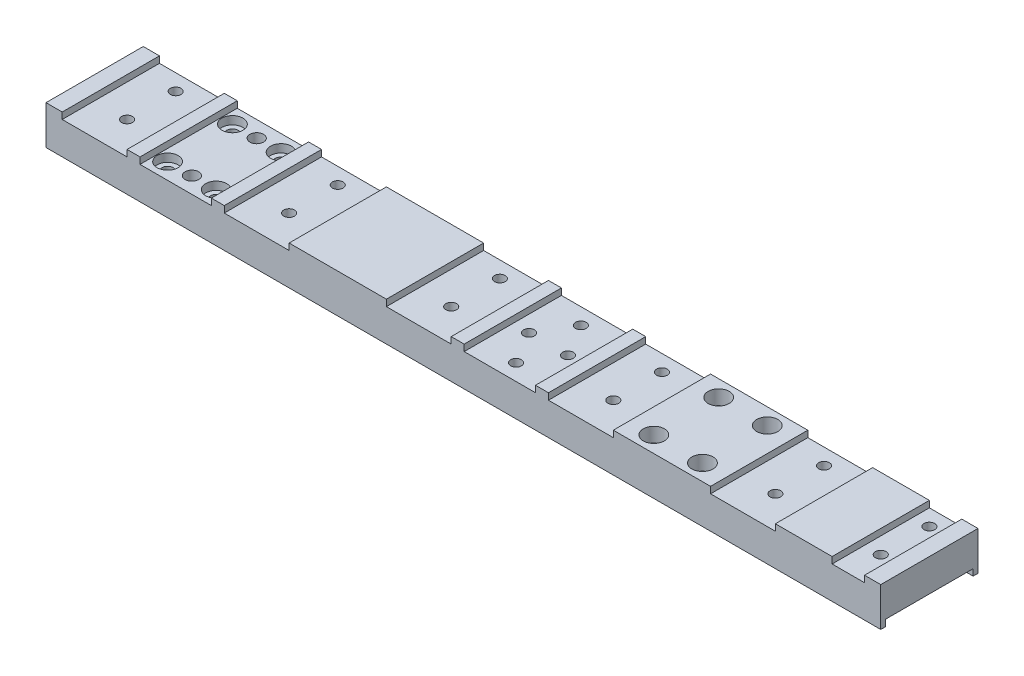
ISO-10303-21;
HEADER;
FILE_DESCRIPTION(('STEP AP214'),'2;1');
FILE_NAME('part.step','',(''),(''),'','','');
FILE_SCHEMA(('AUTOMOTIVE_DESIGN { 1 0 10303 214 1 1 1 1 }'));
ENDSEC;
DATA;
#1=APPLICATION_CONTEXT('core data for automotive mechanical design processes');
#2=APPLICATION_PROTOCOL_DEFINITION('international standard','automotive_design',2000,#1);
#3=PRODUCT_CONTEXT('',#1,'mechanical');
#4=PRODUCT('Part','Part','',(#3));
#5=PRODUCT_RELATED_PRODUCT_CATEGORY('part','',(#4));
#6=PRODUCT_DEFINITION_FORMATION('','',#4);
#7=PRODUCT_DEFINITION_CONTEXT('part definition',#1,'design');
#8=PRODUCT_DEFINITION('design','',#6,#7);
#9=PRODUCT_DEFINITION_SHAPE('','',#8);
#10=(LENGTH_UNIT() NAMED_UNIT(*) SI_UNIT(.MILLI.,.METRE.));
#11=(NAMED_UNIT(*) PLANE_ANGLE_UNIT() SI_UNIT($,.RADIAN.));
#12=(NAMED_UNIT(*) SI_UNIT($,.STERADIAN.) SOLID_ANGLE_UNIT());
#13=UNCERTAINTY_MEASURE_WITH_UNIT(LENGTH_MEASURE(1.E-05),#10,'distance_accuracy_value','');
#14=(GEOMETRIC_REPRESENTATION_CONTEXT(3) GLOBAL_UNCERTAINTY_ASSIGNED_CONTEXT((#13)) GLOBAL_UNIT_ASSIGNED_CONTEXT((#10,
#11,#12)) REPRESENTATION_CONTEXT('',''));
#15=CARTESIAN_POINT('',(0.,0.,0.));
#16=DIRECTION('',(0.,0.,1.));
#17=DIRECTION('',(1.,0.,0.));
#18=AXIS2_PLACEMENT_3D('',#15,#16,#17);
#19=CARTESIAN_POINT('',(182.500000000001,-20.,25.));
#20=DIRECTION('',(0.,1.,0.));
#21=DIRECTION('',(0.,0.,1.));
#22=AXIS2_PLACEMENT_3D('',#19,#20,#21);
#23=CYLINDRICAL_SURFACE('',#22,1.75);
#24=CARTESIAN_POINT('',(182.500000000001,2.,25.));
#25=DIRECTION('',(0.,-1.,0.));
#26=DIRECTION('',(0.,0.,-1.));
#27=AXIS2_PLACEMENT_3D('',#24,#25,#26);
#28=CIRCLE('',#27,1.75);
#29=CARTESIAN_POINT('',(182.500000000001,2.,23.25));
#30=VERTEX_POINT('',#29);
#31=EDGE_CURVE('E646',#30,#30,#28,.T.);
#32=ORIENTED_EDGE('',*,*,#31,.T.);
#33=EDGE_LOOP('',(#32));
#34=FACE_BOUND('',#33,.T.);
#35=CARTESIAN_POINT('',(182.500000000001,7.5,25.));
#36=DIRECTION('',(0.,1.,0.));
#37=DIRECTION('',(0.,0.,1.));
#38=AXIS2_PLACEMENT_3D('',#35,#36,#37);
#39=CIRCLE('',#38,1.75);
#40=CARTESIAN_POINT('',(182.500000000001,7.5,26.75));
#41=VERTEX_POINT('',#40);
#42=EDGE_CURVE('E36',#41,#41,#39,.F.);
#43=ORIENTED_EDGE('',*,*,#42,.F.);
#44=EDGE_LOOP('',(#43));
#45=FACE_BOUND('',#44,.T.);
#46=ADVANCED_FACE('F32',(#34,#45),#23,.F.);
#47=CARTESIAN_POINT('',(197.500000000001,-20.,25.));
#48=DIRECTION('',(0.,1.,0.));
#49=DIRECTION('',(0.,0.,1.));
#50=AXIS2_PLACEMENT_3D('',#47,#48,#49);
#51=CYLINDRICAL_SURFACE('',#50,1.75);
#52=CARTESIAN_POINT('',(197.500000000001,2.,25.));
#53=DIRECTION('',(0.,-1.,0.));
#54=DIRECTION('',(0.,0.,-1.));
#55=AXIS2_PLACEMENT_3D('',#52,#53,#54);
#56=CIRCLE('',#55,1.75);
#57=CARTESIAN_POINT('',(197.500000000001,2.,23.25));
#58=VERTEX_POINT('',#57);
#59=EDGE_CURVE('E643',#58,#58,#56,.T.);
#60=ORIENTED_EDGE('',*,*,#59,.T.);
#61=EDGE_LOOP('',(#60));
#62=FACE_BOUND('',#61,.T.);
#63=CARTESIAN_POINT('',(197.500000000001,7.5,25.));
#64=DIRECTION('',(0.,1.,0.));
#65=DIRECTION('',(0.,0.,1.));
#66=AXIS2_PLACEMENT_3D('',#63,#64,#65);
#67=CIRCLE('',#66,1.75);
#68=CARTESIAN_POINT('',(197.500000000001,7.5,26.75));
#69=VERTEX_POINT('',#68);
#70=EDGE_CURVE('E709',#69,#69,#67,.F.);
#71=ORIENTED_EDGE('',*,*,#70,.F.);
#72=EDGE_LOOP('',(#71));
#73=FACE_BOUND('',#72,.T.);
#74=ADVANCED_FACE('F976',(#62,#73),#51,.F.);
#75=CARTESIAN_POINT('',(197.500000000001,-20.,5.));
#76=DIRECTION('',(0.,1.,0.));
#77=DIRECTION('',(0.,0.,1.));
#78=AXIS2_PLACEMENT_3D('',#75,#76,#77);
#79=CYLINDRICAL_SURFACE('',#78,1.75);
#80=CARTESIAN_POINT('',(197.500000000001,2.,5.));
#81=DIRECTION('',(0.,-1.,0.));
#82=DIRECTION('',(0.,0.,-1.));
#83=AXIS2_PLACEMENT_3D('',#80,#81,#82);
#84=CIRCLE('',#83,1.75);
#85=CARTESIAN_POINT('',(197.500000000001,2.,3.25));
#86=VERTEX_POINT('',#85);
#87=EDGE_CURVE('E640',#86,#86,#84,.T.);
#88=ORIENTED_EDGE('',*,*,#87,.T.);
#89=EDGE_LOOP('',(#88));
#90=FACE_BOUND('',#89,.T.);
#91=CARTESIAN_POINT('',(197.500000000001,7.5,5.));
#92=DIRECTION('',(0.,1.,0.));
#93=DIRECTION('',(0.,0.,1.));
#94=AXIS2_PLACEMENT_3D('',#91,#92,#93);
#95=CIRCLE('',#94,1.75);
#96=CARTESIAN_POINT('',(197.500000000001,7.5,6.75));
#97=VERTEX_POINT('',#96);
#98=EDGE_CURVE('E705',#97,#97,#95,.F.);
#99=ORIENTED_EDGE('',*,*,#98,.F.);
#100=EDGE_LOOP('',(#99));
#101=FACE_BOUND('',#100,.T.);
#102=ADVANCED_FACE('F982',(#90,#101),#79,.F.);
#103=CARTESIAN_POINT('',(182.500000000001,-20.,5.));
#104=DIRECTION('',(0.,1.,0.));
#105=DIRECTION('',(0.,0.,1.));
#106=AXIS2_PLACEMENT_3D('',#103,#104,#105);
#107=CYLINDRICAL_SURFACE('',#106,1.75);
#108=CARTESIAN_POINT('',(182.500000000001,2.,5.));
#109=DIRECTION('',(0.,-1.,0.));
#110=DIRECTION('',(0.,0.,-1.));
#111=AXIS2_PLACEMENT_3D('',#108,#109,#110);
#112=CIRCLE('',#111,1.75);
#113=CARTESIAN_POINT('',(182.500000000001,2.,3.25));
#114=VERTEX_POINT('',#113);
#115=EDGE_CURVE('E637',#114,#114,#112,.T.);
#116=ORIENTED_EDGE('',*,*,#115,.T.);
#117=EDGE_LOOP('',(#116));
#118=FACE_BOUND('',#117,.T.);
#119=CARTESIAN_POINT('',(182.500000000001,7.5,5.));
#120=DIRECTION('',(0.,1.,0.));
#121=DIRECTION('',(0.,0.,1.));
#122=AXIS2_PLACEMENT_3D('',#119,#120,#121);
#123=CIRCLE('',#122,1.75);
#124=CARTESIAN_POINT('',(182.500000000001,7.5,6.75));
#125=VERTEX_POINT('',#124);
#126=EDGE_CURVE('E701',#125,#125,#123,.F.);
#127=ORIENTED_EDGE('',*,*,#126,.F.);
#128=EDGE_LOOP('',(#127));
#129=FACE_BOUND('',#128,.T.);
#130=ADVANCED_FACE('F992',(#118,#129),#107,.F.);
#131=CARTESIAN_POINT('',(32.5,-20.,25.));
#132=DIRECTION('',(0.,1.,0.));
#133=DIRECTION('',(0.,0.,1.));
#134=AXIS2_PLACEMENT_3D('',#131,#132,#133);
#135=CYLINDRICAL_SURFACE('',#134,1.75);
#136=CARTESIAN_POINT('',(32.5,2.,25.));
#137=DIRECTION('',(0.,-1.,0.));
#138=DIRECTION('',(0.,0.,-1.));
#139=AXIS2_PLACEMENT_3D('',#136,#137,#138);
#140=CIRCLE('',#139,1.75);
#141=CARTESIAN_POINT('',(32.5,2.,23.25));
#142=VERTEX_POINT('',#141);
#143=EDGE_CURVE('E634',#142,#142,#140,.T.);
#144=ORIENTED_EDGE('',*,*,#143,.T.);
#145=EDGE_LOOP('',(#144));
#146=FACE_BOUND('',#145,.T.);
#147=CARTESIAN_POINT('',(32.5,7.5,25.));
#148=DIRECTION('',(0.,1.,0.));
#149=DIRECTION('',(0.,0.,1.));
#150=AXIS2_PLACEMENT_3D('',#147,#148,#149);
#151=CIRCLE('',#150,1.75);
#152=CARTESIAN_POINT('',(32.5,7.5,26.75));
#153=VERTEX_POINT('',#152);
#154=EDGE_CURVE('E694',#153,#153,#151,.F.);
#155=ORIENTED_EDGE('',*,*,#154,.F.);
#156=EDGE_LOOP('',(#155));
#157=FACE_BOUND('',#156,.T.);
#158=ADVANCED_FACE('F996',(#146,#157),#135,.F.);
#159=CARTESIAN_POINT('',(47.5,-20.,25.));
#160=DIRECTION('',(0.,1.,0.));
#161=DIRECTION('',(0.,0.,1.));
#162=AXIS2_PLACEMENT_3D('',#159,#160,#161);
#163=CYLINDRICAL_SURFACE('',#162,1.75);
#164=CARTESIAN_POINT('',(47.5,2.,25.));
#165=DIRECTION('',(0.,-1.,0.));
#166=DIRECTION('',(0.,0.,-1.));
#167=AXIS2_PLACEMENT_3D('',#164,#165,#166);
#168=CIRCLE('',#167,1.75);
#169=CARTESIAN_POINT('',(47.5,2.,23.25));
#170=VERTEX_POINT('',#169);
#171=EDGE_CURVE('E631',#170,#170,#168,.T.);
#172=ORIENTED_EDGE('',*,*,#171,.T.);
#173=EDGE_LOOP('',(#172));
#174=FACE_BOUND('',#173,.T.);
#175=CARTESIAN_POINT('',(47.5,7.5,25.));
#176=DIRECTION('',(0.,1.,0.));
#177=DIRECTION('',(0.,0.,1.));
#178=AXIS2_PLACEMENT_3D('',#175,#176,#177);
#179=CIRCLE('',#178,1.75);
#180=CARTESIAN_POINT('',(47.5,7.5,26.75));
#181=VERTEX_POINT('',#180);
#182=EDGE_CURVE('E687',#181,#181,#179,.F.);
#183=ORIENTED_EDGE('',*,*,#182,.F.);
#184=EDGE_LOOP('',(#183));
#185=FACE_BOUND('',#184,.T.);
#186=ADVANCED_FACE('F1000',(#174,#185),#163,.F.);
#187=CARTESIAN_POINT('',(47.5,-20.,5.));
#188=DIRECTION('',(0.,1.,0.));
#189=DIRECTION('',(0.,0.,1.));
#190=AXIS2_PLACEMENT_3D('',#187,#188,#189);
#191=CYLINDRICAL_SURFACE('',#190,1.75);
#192=CARTESIAN_POINT('',(47.5,2.,5.));
#193=DIRECTION('',(0.,-1.,0.));
#194=DIRECTION('',(0.,0.,-1.));
#195=AXIS2_PLACEMENT_3D('',#192,#193,#194);
#196=CIRCLE('',#195,1.75);
#197=CARTESIAN_POINT('',(47.5,2.,3.25));
#198=VERTEX_POINT('',#197);
#199=EDGE_CURVE('E628',#198,#198,#196,.T.);
#200=ORIENTED_EDGE('',*,*,#199,.T.);
#201=EDGE_LOOP('',(#200));
#202=FACE_BOUND('',#201,.T.);
#203=CARTESIAN_POINT('',(47.5,7.5,5.));
#204=DIRECTION('',(0.,1.,0.));
#205=DIRECTION('',(0.,0.,1.));
#206=AXIS2_PLACEMENT_3D('',#203,#204,#205);
#207=CIRCLE('',#206,1.75);
#208=CARTESIAN_POINT('',(47.5,7.5,6.75));
#209=VERTEX_POINT('',#208);
#210=EDGE_CURVE('E680',#209,#209,#207,.F.);
#211=ORIENTED_EDGE('',*,*,#210,.F.);
#212=EDGE_LOOP('',(#211));
#213=FACE_BOUND('',#212,.T.);
#214=ADVANCED_FACE('F1004',(#202,#213),#191,.F.);
#215=CARTESIAN_POINT('',(32.5,-20.,5.));
#216=DIRECTION('',(0.,1.,0.));
#217=DIRECTION('',(0.,0.,1.));
#218=AXIS2_PLACEMENT_3D('',#215,#216,#217);
#219=CYLINDRICAL_SURFACE('',#218,1.75);
#220=CARTESIAN_POINT('',(32.5,2.,5.));
#221=DIRECTION('',(0.,-1.,0.));
#222=DIRECTION('',(0.,0.,-1.));
#223=AXIS2_PLACEMENT_3D('',#220,#221,#222);
#224=CIRCLE('',#223,1.75);
#225=CARTESIAN_POINT('',(32.5,2.,3.25));
#226=VERTEX_POINT('',#225);
#227=EDGE_CURVE('E625',#226,#226,#224,.T.);
#228=ORIENTED_EDGE('',*,*,#227,.T.);
#229=EDGE_LOOP('',(#228));
#230=FACE_BOUND('',#229,.T.);
#231=CARTESIAN_POINT('',(32.5,7.5,5.));
#232=DIRECTION('',(0.,1.,0.));
#233=DIRECTION('',(0.,0.,1.));
#234=AXIS2_PLACEMENT_3D('',#231,#232,#233);
#235=CIRCLE('',#234,1.75);
#236=CARTESIAN_POINT('',(32.5,7.5,6.75));
#237=VERTEX_POINT('',#236);
#238=EDGE_CURVE('E673',#237,#237,#235,.F.);
#239=ORIENTED_EDGE('',*,*,#238,.F.);
#240=EDGE_LOOP('',(#239));
#241=FACE_BOUND('',#240,.T.);
#242=ADVANCED_FACE('F1008',(#230,#241),#219,.F.);
#243=CARTESIAN_POINT('',(0.,0.,30.));
#244=DIRECTION('',(1.,0.,0.));
#245=DIRECTION('',(0.,0.,-1.));
#246=AXIS2_PLACEMENT_3D('',#243,#244,#245);
#247=PLANE('',#246);
#248=DIRECTION('',(0.,1.,0.));
#249=VECTOR('',#248,1.);
#250=CARTESIAN_POINT('',(0.,0.,28.5));
#251=LINE('',#250,#249);
#252=CARTESIAN_POINT('',(0.,0.,28.5));
#253=VERTEX_POINT('',#252);
#254=CARTESIAN_POINT('',(0.,2.,28.5));
#255=VERTEX_POINT('',#254);
#256=EDGE_CURVE('E320',#253,#255,#251,.T.);
#257=ORIENTED_EDGE('',*,*,#256,.F.);
#258=DIRECTION('',(0.,0.,-1.));
#259=VECTOR('',#258,1.);
#260=CARTESIAN_POINT('',(0.,0.,30.));
#261=LINE('',#260,#259);
#262=CARTESIAN_POINT('',(0.,0.,30.));
#263=VERTEX_POINT('',#262);
#264=EDGE_CURVE('E570',#263,#253,#261,.T.);
#265=ORIENTED_EDGE('',*,*,#264,.F.);
#266=DIRECTION('',(0.,-1.,0.));
#267=VECTOR('',#266,1.);
#268=CARTESIAN_POINT('',(0.,0.,30.));
#269=LINE('',#268,#267);
#270=CARTESIAN_POINT('',(0.,12.,30.));
#271=VERTEX_POINT('',#270);
#272=EDGE_CURVE('E329',#271,#263,#269,.T.);
#273=ORIENTED_EDGE('',*,*,#272,.F.);
#274=DIRECTION('',(0.,0.,-1.));
#275=VECTOR('',#274,1.);
#276=CARTESIAN_POINT('',(0.,12.,30.));
#277=LINE('',#276,#275);
#278=CARTESIAN_POINT('',(0.,12.,0.));
#279=VERTEX_POINT('',#278);
#280=EDGE_CURVE('E573',#271,#279,#277,.T.);
#281=ORIENTED_EDGE('',*,*,#280,.T.);
#282=DIRECTION('',(0.,-1.,0.));
#283=VECTOR('',#282,1.);
#284=CARTESIAN_POINT('',(0.,0.,0.));
#285=LINE('',#284,#283);
#286=CARTESIAN_POINT('',(0.,0.,0.));
#287=VERTEX_POINT('',#286);
#288=EDGE_CURVE('E402',#279,#287,#285,.T.);
#289=ORIENTED_EDGE('',*,*,#288,.T.);
#290=CARTESIAN_POINT('',(0.,0.,1.5));
#291=VERTEX_POINT('',#290);
#292=EDGE_CURVE('E569',#291,#287,#261,.T.);
#293=ORIENTED_EDGE('',*,*,#292,.F.);
#294=DIRECTION('',(0.,-1.,0.));
#295=VECTOR('',#294,1.);
#296=CARTESIAN_POINT('',(0.,0.,1.5));
#297=LINE('',#296,#295);
#298=CARTESIAN_POINT('',(0.,2.,1.5));
#299=VERTEX_POINT('',#298);
#300=EDGE_CURVE('E54',#299,#291,#297,.T.);
#301=ORIENTED_EDGE('',*,*,#300,.F.);
#302=DIRECTION('',(0.,0.,-1.));
#303=VECTOR('',#302,1.);
#304=CARTESIAN_POINT('',(0.,2.,30.));
#305=LINE('',#304,#303);
#306=EDGE_CURVE('E49',#255,#299,#305,.T.);
#307=ORIENTED_EDGE('',*,*,#306,.F.);
#308=EDGE_LOOP('',(#257,#265,#273,#281,#289,#293,#301,#307));
#309=FACE_BOUND('',#308,.T.);
#310=ADVANCED_FACE('F957',(#309),#247,.F.);
#311=CARTESIAN_POINT('',(0.,0.,30.));
#312=DIRECTION('',(0.,1.,0.));
#313=DIRECTION('',(0.,0.,1.));
#314=AXIS2_PLACEMENT_3D('',#311,#312,#313);
#315=PLANE('',#314);
#316=DIRECTION('',(-1.,0.,0.));
#317=VECTOR('',#316,1.);
#318=CARTESIAN_POINT('',(897.524083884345,0.,28.5));
#319=LINE('',#318,#317);
#320=CARTESIAN_POINT('',(257.500000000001,0.,28.5));
#321=VERTEX_POINT('',#320);
#322=EDGE_CURVE('E310',#321,#253,#319,.T.);
#323=ORIENTED_EDGE('',*,*,#322,.F.);
#324=DIRECTION('',(0.,0.,-1.));
#325=VECTOR('',#324,1.);
#326=CARTESIAN_POINT('',(257.500000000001,0.,30.));
#327=LINE('',#326,#325);
#328=CARTESIAN_POINT('',(257.500000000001,0.,30.));
#329=VERTEX_POINT('',#328);
#330=EDGE_CURVE('E567',#329,#321,#327,.T.);
#331=ORIENTED_EDGE('',*,*,#330,.F.);
#332=DIRECTION('',(1.,0.,0.));
#333=VECTOR('',#332,1.);
#334=CARTESIAN_POINT('',(0.,0.,30.));
#335=LINE('',#334,#333);
#336=EDGE_CURVE('E331',#263,#329,#335,.T.);
#337=ORIENTED_EDGE('',*,*,#336,.F.);
#338=ORIENTED_EDGE('',*,*,#264,.T.);
#339=EDGE_LOOP('',(#323,#331,#337,#338));
#340=FACE_BOUND('',#339,.T.);
#341=ADVANCED_FACE('F962',(#340),#315,.F.);
#342=DIRECTION('',(-1.,0.,0.));
#343=VECTOR('',#342,1.);
#344=CARTESIAN_POINT('',(897.524083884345,0.,1.5));
#345=LINE('',#344,#343);
#346=CARTESIAN_POINT('',(257.500000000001,0.,1.5));
#347=VERTEX_POINT('',#346);
#348=EDGE_CURVE('E304',#347,#291,#345,.T.);
#349=ORIENTED_EDGE('',*,*,#348,.T.);
#350=ORIENTED_EDGE('',*,*,#292,.T.);
#351=DIRECTION('',(1.,0.,0.));
#352=VECTOR('',#351,1.);
#353=CARTESIAN_POINT('',(0.,0.,0.));
#354=LINE('',#353,#352);
#355=CARTESIAN_POINT('',(257.500000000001,0.,0.));
#356=VERTEX_POINT('',#355);
#357=EDGE_CURVE('E405',#287,#356,#354,.T.);
#358=ORIENTED_EDGE('',*,*,#357,.T.);
#359=EDGE_CURVE('E566',#347,#356,#327,.T.);
#360=ORIENTED_EDGE('',*,*,#359,.F.);
#361=EDGE_LOOP('',(#349,#350,#358,#360));
#362=FACE_BOUND('',#361,.T.);
#363=ADVANCED_FACE('F956',(#362),#315,.F.);
#364=CARTESIAN_POINT('',(257.500000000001,0.,30.));
#365=DIRECTION('',(-1.,0.,0.));
#366=DIRECTION('',(0.,0.,1.));
#367=AXIS2_PLACEMENT_3D('',#364,#365,#366);
#368=PLANE('',#367);
#369=DIRECTION('',(0.,-1.,0.));
#370=VECTOR('',#369,1.);
#371=CARTESIAN_POINT('',(257.500000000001,0.,28.5));
#372=LINE('',#371,#370);
#373=CARTESIAN_POINT('',(257.500000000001,2.,28.5));
#374=VERTEX_POINT('',#373);
#375=EDGE_CURVE('E11',#374,#321,#372,.T.);
#376=ORIENTED_EDGE('',*,*,#375,.F.);
#377=DIRECTION('',(0.,0.,1.));
#378=VECTOR('',#377,1.);
#379=CARTESIAN_POINT('',(257.500000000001,2.,30.));
#380=LINE('',#379,#378);
#381=CARTESIAN_POINT('',(257.500000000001,2.,1.5));
#382=VERTEX_POINT('',#381);
#383=EDGE_CURVE('E41',#382,#374,#380,.T.);
#384=ORIENTED_EDGE('',*,*,#383,.F.);
#385=DIRECTION('',(0.,1.,0.));
#386=VECTOR('',#385,1.);
#387=CARTESIAN_POINT('',(257.500000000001,0.,1.5));
#388=LINE('',#387,#386);
#389=EDGE_CURVE('E291',#347,#382,#388,.T.);
#390=ORIENTED_EDGE('',*,*,#389,.F.);
#391=ORIENTED_EDGE('',*,*,#359,.T.);
#392=DIRECTION('',(0.,1.,0.));
#393=VECTOR('',#392,1.);
#394=CARTESIAN_POINT('',(257.500000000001,0.,0.));
#395=LINE('',#394,#393);
#396=CARTESIAN_POINT('',(257.500000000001,12.,0.));
#397=VERTEX_POINT('',#396);
#398=EDGE_CURVE('E408',#356,#397,#395,.T.);
#399=ORIENTED_EDGE('',*,*,#398,.T.);
#400=DIRECTION('',(0.,0.,-1.));
#401=VECTOR('',#400,1.);
#402=CARTESIAN_POINT('',(257.500000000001,12.,30.));
#403=LINE('',#402,#401);
#404=CARTESIAN_POINT('',(257.500000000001,12.,30.));
#405=VERTEX_POINT('',#404);
#406=EDGE_CURVE('E563',#405,#397,#403,.T.);
#407=ORIENTED_EDGE('',*,*,#406,.F.);
#408=DIRECTION('',(0.,1.,0.));
#409=VECTOR('',#408,1.);
#410=CARTESIAN_POINT('',(257.500000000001,0.,30.));
#411=LINE('',#410,#409);
#412=EDGE_CURVE('E333',#329,#405,#411,.T.);
#413=ORIENTED_EDGE('',*,*,#412,.F.);
#414=ORIENTED_EDGE('',*,*,#330,.T.);
#415=EDGE_LOOP('',(#376,#384,#390,#391,#399,#407,#413,#414));
#416=FACE_BOUND('',#415,.T.);
#417=ADVANCED_FACE('F290',(#416),#368,.F.);
#418=CARTESIAN_POINT('',(5.,12.,30.));
#419=DIRECTION('',(-1.,0.,0.));
#420=DIRECTION('',(0.,0.,1.));
#421=AXIS2_PLACEMENT_3D('',#418,#419,#420);
#422=PLANE('',#421);
#423=DIRECTION('',(0.,1.,0.));
#424=VECTOR('',#423,1.);
#425=CARTESIAN_POINT('',(5.,12.,0.));
#426=LINE('',#425,#424);
#427=CARTESIAN_POINT('',(5.,10.,0.));
#428=VERTEX_POINT('',#427);
#429=CARTESIAN_POINT('',(5.,12.,0.));
#430=VERTEX_POINT('',#429);
#431=EDGE_CURVE('E322',#428,#430,#426,.T.);
#432=ORIENTED_EDGE('',*,*,#431,.T.);
#433=DIRECTION('',(0.,0.,-1.));
#434=VECTOR('',#433,1.);
#435=CARTESIAN_POINT('',(5.,12.,30.));
#436=LINE('',#435,#434);
#437=CARTESIAN_POINT('',(5.,12.,30.));
#438=VERTEX_POINT('',#437);
#439=EDGE_CURVE('E305',#438,#430,#436,.T.);
#440=ORIENTED_EDGE('',*,*,#439,.F.);
#441=DIRECTION('',(0.,1.,0.));
#442=VECTOR('',#441,1.);
#443=CARTESIAN_POINT('',(5.,12.,30.));
#444=LINE('',#443,#442);
#445=CARTESIAN_POINT('',(5.,10.,30.));
#446=VERTEX_POINT('',#445);
#447=EDGE_CURVE('E323',#446,#438,#444,.T.);
#448=ORIENTED_EDGE('',*,*,#447,.F.);
#449=DIRECTION('',(0.,0.,-1.));
#450=VECTOR('',#449,1.);
#451=CARTESIAN_POINT('',(5.,10.,30.));
#452=LINE('',#451,#450);
#453=EDGE_CURVE('E397',#446,#428,#452,.T.);
#454=ORIENTED_EDGE('',*,*,#453,.T.);
#455=EDGE_LOOP('',(#432,#440,#448,#454));
#456=FACE_BOUND('',#455,.T.);
#457=ADVANCED_FACE('F34',(#456),#422,.F.);
#458=CARTESIAN_POINT('',(0.,12.,30.));
#459=DIRECTION('',(0.,-1.,0.));
#460=DIRECTION('',(0.,0.,-1.));
#461=AXIS2_PLACEMENT_3D('',#458,#459,#460);
#462=PLANE('',#461);
#463=DIRECTION('',(-1.,0.,0.));
#464=VECTOR('',#463,1.);
#465=CARTESIAN_POINT('',(0.,12.,0.));
#466=LINE('',#465,#464);
#467=EDGE_CURVE('E400',#430,#279,#466,.T.);
#468=ORIENTED_EDGE('',*,*,#467,.T.);
#469=ORIENTED_EDGE('',*,*,#280,.F.);
#470=DIRECTION('',(-1.,0.,0.));
#471=VECTOR('',#470,1.);
#472=CARTESIAN_POINT('',(0.,12.,30.));
#473=LINE('',#472,#471);
#474=EDGE_CURVE('E326',#438,#271,#473,.T.);
#475=ORIENTED_EDGE('',*,*,#474,.F.);
#476=ORIENTED_EDGE('',*,*,#439,.T.);
#477=EDGE_LOOP('',(#468,#469,#475,#476));
#478=FACE_BOUND('',#477,.T.);
#479=ADVANCED_FACE('F802',(#478),#462,.F.);
#480=CARTESIAN_POINT('',(252.500000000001,12.,30.));
#481=DIRECTION('',(0.,-1.,0.));
#482=DIRECTION('',(0.,0.,-1.));
#483=AXIS2_PLACEMENT_3D('',#480,#481,#482);
#484=PLANE('',#483);
#485=DIRECTION('',(-1.,0.,0.));
#486=VECTOR('',#485,1.);
#487=CARTESIAN_POINT('',(252.500000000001,12.,0.));
#488=LINE('',#487,#486);
#489=CARTESIAN_POINT('',(252.500000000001,12.,0.));
#490=VERTEX_POINT('',#489);
#491=EDGE_CURVE('E410',#397,#490,#488,.T.);
#492=ORIENTED_EDGE('',*,*,#491,.T.);
#493=DIRECTION('',(0.,0.,-1.));
#494=VECTOR('',#493,1.);
#495=CARTESIAN_POINT('',(252.500000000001,12.,30.));
#496=LINE('',#495,#494);
#497=CARTESIAN_POINT('',(252.500000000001,12.,30.));
#498=VERTEX_POINT('',#497);
#499=EDGE_CURVE('E560',#498,#490,#496,.T.);
#500=ORIENTED_EDGE('',*,*,#499,.F.);
#501=DIRECTION('',(-1.,0.,0.));
#502=VECTOR('',#501,1.);
#503=CARTESIAN_POINT('',(252.500000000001,12.,30.));
#504=LINE('',#503,#502);
#505=EDGE_CURVE('E335',#405,#498,#504,.T.);
#506=ORIENTED_EDGE('',*,*,#505,.F.);
#507=ORIENTED_EDGE('',*,*,#406,.T.);
#508=EDGE_LOOP('',(#492,#500,#506,#507));
#509=FACE_BOUND('',#508,.T.);
#510=ADVANCED_FACE('F952',(#509),#484,.F.);
#511=CARTESIAN_POINT('',(252.500000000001,12.,30.));
#512=DIRECTION('',(1.,0.,0.));
#513=DIRECTION('',(0.,0.,-1.));
#514=AXIS2_PLACEMENT_3D('',#511,#512,#513);
#515=PLANE('',#514);
#516=DIRECTION('',(0.,-1.,0.));
#517=VECTOR('',#516,1.);
#518=CARTESIAN_POINT('',(252.500000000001,12.,0.));
#519=LINE('',#518,#517);
#520=CARTESIAN_POINT('',(252.500000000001,10.,0.));
#521=VERTEX_POINT('',#520);
#522=EDGE_CURVE('E412',#490,#521,#519,.T.);
#523=ORIENTED_EDGE('',*,*,#522,.T.);
#524=DIRECTION('',(0.,0.,-1.));
#525=VECTOR('',#524,1.);
#526=CARTESIAN_POINT('',(252.500000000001,10.,30.));
#527=LINE('',#526,#525);
#528=CARTESIAN_POINT('',(252.500000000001,10.,30.));
#529=VERTEX_POINT('',#528);
#530=EDGE_CURVE('E557',#529,#521,#527,.T.);
#531=ORIENTED_EDGE('',*,*,#530,.F.);
#532=DIRECTION('',(0.,-1.,0.));
#533=VECTOR('',#532,1.);
#534=CARTESIAN_POINT('',(252.500000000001,12.,30.));
#535=LINE('',#534,#533);
#536=EDGE_CURVE('E337',#498,#529,#535,.T.);
#537=ORIENTED_EDGE('',*,*,#536,.F.);
#538=ORIENTED_EDGE('',*,*,#499,.T.);
#539=EDGE_LOOP('',(#523,#531,#537,#538));
#540=FACE_BOUND('',#539,.T.);
#541=ADVANCED_FACE('F947',(#540),#515,.F.);
#542=CARTESIAN_POINT('',(242.500000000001,10.,30.));
#543=DIRECTION('',(0.,-1.,0.));
#544=DIRECTION('',(0.,0.,-1.));
#545=AXIS2_PLACEMENT_3D('',#542,#543,#544);
#546=PLANE('',#545);
#547=CARTESIAN_POINT('',(247.500000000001,10.,5.));
#548=DIRECTION('',(0.,1.,0.));
#549=DIRECTION('',(0.,0.,1.));
#550=AXIS2_PLACEMENT_3D('',#547,#548,#549);
#551=CIRCLE('',#550,1.65000000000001);
#552=CARTESIAN_POINT('',(247.500000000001,10.,6.65000000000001));
#553=VERTEX_POINT('',#552);
#554=EDGE_CURVE('E624',#553,#553,#551,.T.);
#555=ORIENTED_EDGE('',*,*,#554,.F.);
#556=EDGE_LOOP('',(#555));
#557=FACE_BOUND('',#556,.T.);
#558=CARTESIAN_POINT('',(247.500000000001,10.,20.));
#559=DIRECTION('',(0.,1.,0.));
#560=DIRECTION('',(0.,0.,1.));
#561=AXIS2_PLACEMENT_3D('',#558,#559,#560);
#562=CIRCLE('',#561,1.65000000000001);
#563=CARTESIAN_POINT('',(247.500000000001,10.,21.65));
#564=VERTEX_POINT('',#563);
#565=EDGE_CURVE('E620',#564,#564,#562,.T.);
#566=ORIENTED_EDGE('',*,*,#565,.F.);
#567=EDGE_LOOP('',(#566));
#568=FACE_BOUND('',#567,.T.);
#569=DIRECTION('',(-1.,0.,0.));
#570=VECTOR('',#569,1.);
#571=CARTESIAN_POINT('',(242.500000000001,10.,0.));
#572=LINE('',#571,#570);
#573=CARTESIAN_POINT('',(242.500000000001,10.,0.));
#574=VERTEX_POINT('',#573);
#575=EDGE_CURVE('E414',#521,#574,#572,.T.);
#576=ORIENTED_EDGE('',*,*,#575,.T.);
#577=DIRECTION('',(0.,0.,-1.));
#578=VECTOR('',#577,1.);
#579=CARTESIAN_POINT('',(242.500000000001,10.,30.));
#580=LINE('',#579,#578);
#581=CARTESIAN_POINT('',(242.500000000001,10.,30.));
#582=VERTEX_POINT('',#581);
#583=EDGE_CURVE('E554',#582,#574,#580,.T.);
#584=ORIENTED_EDGE('',*,*,#583,.F.);
#585=DIRECTION('',(-1.,0.,0.));
#586=VECTOR('',#585,1.);
#587=CARTESIAN_POINT('',(242.500000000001,10.,30.));
#588=LINE('',#587,#586);
#589=EDGE_CURVE('E339',#529,#582,#588,.T.);
#590=ORIENTED_EDGE('',*,*,#589,.F.);
#591=ORIENTED_EDGE('',*,*,#530,.T.);
#592=EDGE_LOOP('',(#576,#584,#590,#591));
#593=FACE_BOUND('',#592,.T.);
#594=ADVANCED_FACE('F941',(#557,#568,#593),#546,.F.);
#595=CARTESIAN_POINT('',(242.500000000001,10.,30.));
#596=DIRECTION('',(-1.,0.,0.));
#597=DIRECTION('',(0.,0.,1.));
#598=AXIS2_PLACEMENT_3D('',#595,#596,#597);
#599=PLANE('',#598);
#600=DIRECTION('',(0.,1.,0.));
#601=VECTOR('',#600,1.);
#602=CARTESIAN_POINT('',(242.500000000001,10.,0.));
#603=LINE('',#602,#601);
#604=CARTESIAN_POINT('',(242.500000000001,12.,0.));
#605=VERTEX_POINT('',#604);
#606=EDGE_CURVE('E416',#574,#605,#603,.T.);
#607=ORIENTED_EDGE('',*,*,#606,.T.);
#608=DIRECTION('',(0.,0.,-1.));
#609=VECTOR('',#608,1.);
#610=CARTESIAN_POINT('',(242.500000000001,12.,30.));
#611=LINE('',#610,#609);
#612=CARTESIAN_POINT('',(242.500000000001,12.,30.));
#613=VERTEX_POINT('',#612);
#614=EDGE_CURVE('E551',#613,#605,#611,.T.);
#615=ORIENTED_EDGE('',*,*,#614,.F.);
#616=DIRECTION('',(0.,1.,0.));
#617=VECTOR('',#616,1.);
#618=CARTESIAN_POINT('',(242.500000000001,10.,30.));
#619=LINE('',#618,#617);
#620=EDGE_CURVE('E341',#582,#613,#619,.T.);
#621=ORIENTED_EDGE('',*,*,#620,.F.);
#622=ORIENTED_EDGE('',*,*,#583,.T.);
#623=EDGE_LOOP('',(#607,#615,#621,#622));
#624=FACE_BOUND('',#623,.T.);
#625=ADVANCED_FACE('F937',(#624),#599,.F.);
#626=CARTESIAN_POINT('',(225.000000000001,12.,30.));
#627=DIRECTION('',(0.,-1.,0.));
#628=DIRECTION('',(0.,0.,-1.));
#629=AXIS2_PLACEMENT_3D('',#626,#627,#628);
#630=PLANE('',#629);
#631=DIRECTION('',(-1.,0.,0.));
#632=VECTOR('',#631,1.);
#633=CARTESIAN_POINT('',(225.000000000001,12.,0.));
#634=LINE('',#633,#632);
#635=CARTESIAN_POINT('',(225.000000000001,12.,0.));
#636=VERTEX_POINT('',#635);
#637=EDGE_CURVE('E418',#605,#636,#634,.T.);
#638=ORIENTED_EDGE('',*,*,#637,.T.);
#639=DIRECTION('',(0.,0.,-1.));
#640=VECTOR('',#639,1.);
#641=CARTESIAN_POINT('',(225.000000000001,12.,30.));
#642=LINE('',#641,#640);
#643=CARTESIAN_POINT('',(225.000000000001,12.,30.));
#644=VERTEX_POINT('',#643);
#645=EDGE_CURVE('E548',#644,#636,#642,.T.);
#646=ORIENTED_EDGE('',*,*,#645,.F.);
#647=DIRECTION('',(-1.,0.,0.));
#648=VECTOR('',#647,1.);
#649=CARTESIAN_POINT('',(225.000000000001,12.,30.));
#650=LINE('',#649,#648);
#651=EDGE_CURVE('E343',#613,#644,#650,.T.);
#652=ORIENTED_EDGE('',*,*,#651,.F.);
#653=ORIENTED_EDGE('',*,*,#614,.T.);
#654=EDGE_LOOP('',(#638,#646,#652,#653));
#655=FACE_BOUND('',#654,.T.);
#656=ADVANCED_FACE('F932',(#655),#630,.F.);
#657=CARTESIAN_POINT('',(225.000000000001,12.,30.));
#658=DIRECTION('',(1.,0.,0.));
#659=DIRECTION('',(0.,0.,-1.));
#660=AXIS2_PLACEMENT_3D('',#657,#658,#659);
#661=PLANE('',#660);
#662=DIRECTION('',(0.,-1.,0.));
#663=VECTOR('',#662,1.);
#664=CARTESIAN_POINT('',(225.000000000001,12.,0.));
#665=LINE('',#664,#663);
#666=CARTESIAN_POINT('',(225.000000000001,10.,0.));
#667=VERTEX_POINT('',#666);
#668=EDGE_CURVE('E420',#636,#667,#665,.T.);
#669=ORIENTED_EDGE('',*,*,#668,.T.);
#670=DIRECTION('',(0.,0.,-1.));
#671=VECTOR('',#670,1.);
#672=CARTESIAN_POINT('',(225.000000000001,10.,30.));
#673=LINE('',#672,#671);
#674=CARTESIAN_POINT('',(225.000000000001,10.,30.));
#675=VERTEX_POINT('',#674);
#676=EDGE_CURVE('E545',#675,#667,#673,.T.);
#677=ORIENTED_EDGE('',*,*,#676,.F.);
#678=DIRECTION('',(0.,-1.,0.));
#679=VECTOR('',#678,1.);
#680=CARTESIAN_POINT('',(225.000000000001,12.,30.));
#681=LINE('',#680,#679);
#682=EDGE_CURVE('E345',#644,#675,#681,.T.);
#683=ORIENTED_EDGE('',*,*,#682,.F.);
#684=ORIENTED_EDGE('',*,*,#645,.T.);
#685=EDGE_LOOP('',(#669,#677,#683,#684));
#686=FACE_BOUND('',#685,.T.);
#687=ADVANCED_FACE('F926',(#686),#661,.F.);
#688=CARTESIAN_POINT('',(205.000000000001,10.,30.));
#689=DIRECTION('',(0.,-1.,0.));
#690=DIRECTION('',(0.,0.,-1.));
#691=AXIS2_PLACEMENT_3D('',#688,#689,#690);
#692=PLANE('',#691);
#693=CARTESIAN_POINT('',(215.000000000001,10.,20.));
#694=DIRECTION('',(0.,1.,0.));
#695=DIRECTION('',(0.,0.,1.));
#696=AXIS2_PLACEMENT_3D('',#693,#694,#695);
#697=CIRCLE('',#696,1.65000000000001);
#698=CARTESIAN_POINT('',(215.000000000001,10.,21.65));
#699=VERTEX_POINT('',#698);
#700=EDGE_CURVE('E616',#699,#699,#697,.T.);
#701=ORIENTED_EDGE('',*,*,#700,.F.);
#702=EDGE_LOOP('',(#701));
#703=FACE_BOUND('',#702,.T.);
#704=CARTESIAN_POINT('',(215.,10.,5.));
#705=DIRECTION('',(0.,1.,0.));
#706=DIRECTION('',(0.,0.,1.));
#707=AXIS2_PLACEMENT_3D('',#704,#705,#706);
#708=CIRCLE('',#707,1.65000000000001);
#709=CARTESIAN_POINT('',(215.,10.,6.65000000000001));
#710=VERTEX_POINT('',#709);
#711=EDGE_CURVE('E612',#710,#710,#708,.T.);
#712=ORIENTED_EDGE('',*,*,#711,.F.);
#713=EDGE_LOOP('',(#712));
#714=FACE_BOUND('',#713,.T.);
#715=DIRECTION('',(-1.,0.,0.));
#716=VECTOR('',#715,1.);
#717=CARTESIAN_POINT('',(205.000000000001,10.,0.));
#718=LINE('',#717,#716);
#719=CARTESIAN_POINT('',(205.000000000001,10.,0.));
#720=VERTEX_POINT('',#719);
#721=EDGE_CURVE('E422',#667,#720,#718,.T.);
#722=ORIENTED_EDGE('',*,*,#721,.T.);
#723=DIRECTION('',(0.,0.,-1.));
#724=VECTOR('',#723,1.);
#725=CARTESIAN_POINT('',(205.000000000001,10.,30.));
#726=LINE('',#725,#724);
#727=CARTESIAN_POINT('',(205.000000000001,10.,30.));
#728=VERTEX_POINT('',#727);
#729=EDGE_CURVE('E542',#728,#720,#726,.T.);
#730=ORIENTED_EDGE('',*,*,#729,.F.);
#731=DIRECTION('',(-1.,0.,0.));
#732=VECTOR('',#731,1.);
#733=CARTESIAN_POINT('',(205.000000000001,10.,30.));
#734=LINE('',#733,#732);
#735=EDGE_CURVE('E347',#675,#728,#734,.T.);
#736=ORIENTED_EDGE('',*,*,#735,.F.);
#737=ORIENTED_EDGE('',*,*,#676,.T.);
#738=EDGE_LOOP('',(#722,#730,#736,#737));
#739=FACE_BOUND('',#738,.T.);
#740=ADVANCED_FACE('F922',(#703,#714,#739),#692,.F.);
#741=CARTESIAN_POINT('',(205.000000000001,12.,30.));
#742=DIRECTION('',(-1.,0.,0.));
#743=DIRECTION('',(0.,0.,1.));
#744=AXIS2_PLACEMENT_3D('',#741,#742,#743);
#745=PLANE('',#744);
#746=DIRECTION('',(0.,1.,0.));
#747=VECTOR('',#746,1.);
#748=CARTESIAN_POINT('',(205.000000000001,12.,0.));
#749=LINE('',#748,#747);
#750=CARTESIAN_POINT('',(205.000000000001,12.,0.));
#751=VERTEX_POINT('',#750);
#752=EDGE_CURVE('E424',#720,#751,#749,.T.);
#753=ORIENTED_EDGE('',*,*,#752,.T.);
#754=DIRECTION('',(0.,0.,-1.));
#755=VECTOR('',#754,1.);
#756=CARTESIAN_POINT('',(205.000000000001,12.,30.));
#757=LINE('',#756,#755);
#758=CARTESIAN_POINT('',(205.000000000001,12.,30.));
#759=VERTEX_POINT('',#758);
#760=EDGE_CURVE('E539',#759,#751,#757,.T.);
#761=ORIENTED_EDGE('',*,*,#760,.F.);
#762=DIRECTION('',(0.,1.,0.));
#763=VECTOR('',#762,1.);
#764=CARTESIAN_POINT('',(205.000000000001,12.,30.));
#765=LINE('',#764,#763);
#766=EDGE_CURVE('E349',#728,#759,#765,.T.);
#767=ORIENTED_EDGE('',*,*,#766,.F.);
#768=ORIENTED_EDGE('',*,*,#729,.T.);
#769=EDGE_LOOP('',(#753,#761,#767,#768));
#770=FACE_BOUND('',#769,.T.);
#771=ADVANCED_FACE('F917',(#770),#745,.F.);
#772=CARTESIAN_POINT('',(175.000000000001,12.,30.));
#773=DIRECTION('',(0.,-1.,0.));
#774=DIRECTION('',(0.,0.,-1.));
#775=AXIS2_PLACEMENT_3D('',#772,#773,#774);
#776=PLANE('',#775);
#777=CARTESIAN_POINT('',(182.500000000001,12.,25.));
#778=DIRECTION('',(0.,1.,0.));
#779=DIRECTION('',(0.,0.,1.));
#780=AXIS2_PLACEMENT_3D('',#777,#778,#779);
#781=CIRCLE('',#780,3.25);
#782=CARTESIAN_POINT('',(182.500000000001,12.,28.25));
#783=VERTEX_POINT('',#782);
#784=EDGE_CURVE('E725',#783,#783,#781,.T.);
#785=ORIENTED_EDGE('',*,*,#784,.F.);
#786=EDGE_LOOP('',(#785));
#787=FACE_BOUND('',#786,.T.);
#788=CARTESIAN_POINT('',(197.500000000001,12.,25.));
#789=DIRECTION('',(0.,1.,0.));
#790=DIRECTION('',(0.,0.,1.));
#791=AXIS2_PLACEMENT_3D('',#788,#789,#790);
#792=CIRCLE('',#791,3.25);
#793=CARTESIAN_POINT('',(197.500000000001,12.,28.25));
#794=VERTEX_POINT('',#793);
#795=EDGE_CURVE('E718',#794,#794,#792,.T.);
#796=ORIENTED_EDGE('',*,*,#795,.F.);
#797=EDGE_LOOP('',(#796));
#798=FACE_BOUND('',#797,.T.);
#799=CARTESIAN_POINT('',(197.500000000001,12.,5.));
#800=DIRECTION('',(0.,1.,0.));
#801=DIRECTION('',(0.,0.,1.));
#802=AXIS2_PLACEMENT_3D('',#799,#800,#801);
#803=CIRCLE('',#802,3.25);
#804=CARTESIAN_POINT('',(197.500000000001,12.,8.25));
#805=VERTEX_POINT('',#804);
#806=EDGE_CURVE('E711',#805,#805,#803,.T.);
#807=ORIENTED_EDGE('',*,*,#806,.F.);
#808=EDGE_LOOP('',(#807));
#809=FACE_BOUND('',#808,.T.);
#810=CARTESIAN_POINT('',(182.500000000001,12.,5.));
#811=DIRECTION('',(0.,1.,0.));
#812=DIRECTION('',(0.,0.,1.));
#813=AXIS2_PLACEMENT_3D('',#810,#811,#812);
#814=CIRCLE('',#813,3.25);
#815=CARTESIAN_POINT('',(182.500000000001,12.,8.25));
#816=VERTEX_POINT('',#815);
#817=EDGE_CURVE('E707',#816,#816,#814,.T.);
#818=ORIENTED_EDGE('',*,*,#817,.F.);
#819=EDGE_LOOP('',(#818));
#820=FACE_BOUND('',#819,.T.);
#821=DIRECTION('',(-1.,0.,0.));
#822=VECTOR('',#821,1.);
#823=CARTESIAN_POINT('',(175.000000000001,12.,0.));
#824=LINE('',#823,#822);
#825=CARTESIAN_POINT('',(175.000000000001,12.,0.));
#826=VERTEX_POINT('',#825);
#827=EDGE_CURVE('E426',#751,#826,#824,.T.);
#828=ORIENTED_EDGE('',*,*,#827,.T.);
#829=DIRECTION('',(0.,0.,-1.));
#830=VECTOR('',#829,1.);
#831=CARTESIAN_POINT('',(175.000000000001,12.,30.));
#832=LINE('',#831,#830);
#833=CARTESIAN_POINT('',(175.000000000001,12.,30.));
#834=VERTEX_POINT('',#833);
#835=EDGE_CURVE('E536',#834,#826,#832,.T.);
#836=ORIENTED_EDGE('',*,*,#835,.F.);
#837=DIRECTION('',(-1.,0.,0.));
#838=VECTOR('',#837,1.);
#839=CARTESIAN_POINT('',(175.000000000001,12.,30.));
#840=LINE('',#839,#838);
#841=EDGE_CURVE('E351',#759,#834,#840,.T.);
#842=ORIENTED_EDGE('',*,*,#841,.F.);
#843=ORIENTED_EDGE('',*,*,#760,.T.);
#844=EDGE_LOOP('',(#828,#836,#842,#843));
#845=FACE_BOUND('',#844,.T.);
#846=ADVANCED_FACE('F911',(#787,#798,#809,#820,#845),#776,.F.);
#847=CARTESIAN_POINT('',(175.000000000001,12.,30.));
#848=DIRECTION('',(1.,0.,0.));
#849=DIRECTION('',(0.,0.,-1.));
#850=AXIS2_PLACEMENT_3D('',#847,#848,#849);
#851=PLANE('',#850);
#852=DIRECTION('',(0.,-1.,0.));
#853=VECTOR('',#852,1.);
#854=CARTESIAN_POINT('',(175.000000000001,12.,0.));
#855=LINE('',#854,#853);
#856=CARTESIAN_POINT('',(175.000000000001,10.,0.));
#857=VERTEX_POINT('',#856);
#858=EDGE_CURVE('E428',#826,#857,#855,.T.);
#859=ORIENTED_EDGE('',*,*,#858,.T.);
#860=DIRECTION('',(0.,0.,-1.));
#861=VECTOR('',#860,1.);
#862=CARTESIAN_POINT('',(175.000000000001,10.,30.));
#863=LINE('',#862,#861);
#864=CARTESIAN_POINT('',(175.000000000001,10.,30.));
#865=VERTEX_POINT('',#864);
#866=EDGE_CURVE('E533',#865,#857,#863,.T.);
#867=ORIENTED_EDGE('',*,*,#866,.F.);
#868=DIRECTION('',(0.,-1.,0.));
#869=VECTOR('',#868,1.);
#870=CARTESIAN_POINT('',(175.000000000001,12.,30.));
#871=LINE('',#870,#869);
#872=EDGE_CURVE('E353',#834,#865,#871,.T.);
#873=ORIENTED_EDGE('',*,*,#872,.F.);
#874=ORIENTED_EDGE('',*,*,#835,.T.);
#875=EDGE_LOOP('',(#859,#867,#873,#874));
#876=FACE_BOUND('',#875,.T.);
#877=ADVANCED_FACE('F907',(#876),#851,.F.);
#878=CARTESIAN_POINT('',(155.,10.,30.));
#879=DIRECTION('',(0.,-1.,0.));
#880=DIRECTION('',(0.,0.,-1.));
#881=AXIS2_PLACEMENT_3D('',#878,#879,#880);
#882=PLANE('',#881);
#883=CARTESIAN_POINT('',(165.,10.,20.));
#884=DIRECTION('',(0.,1.,0.));
#885=DIRECTION('',(0.,0.,1.));
#886=AXIS2_PLACEMENT_3D('',#883,#884,#885);
#887=CIRCLE('',#886,1.65000000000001);
#888=CARTESIAN_POINT('',(165.,10.,21.65));
#889=VERTEX_POINT('',#888);
#890=EDGE_CURVE('E608',#889,#889,#887,.T.);
#891=ORIENTED_EDGE('',*,*,#890,.F.);
#892=EDGE_LOOP('',(#891));
#893=FACE_BOUND('',#892,.T.);
#894=CARTESIAN_POINT('',(165.,10.,5.));
#895=DIRECTION('',(0.,1.,0.));
#896=DIRECTION('',(0.,0.,1.));
#897=AXIS2_PLACEMENT_3D('',#894,#895,#896);
#898=CIRCLE('',#897,1.65000000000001);
#899=CARTESIAN_POINT('',(165.,10.,6.65000000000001));
#900=VERTEX_POINT('',#899);
#901=EDGE_CURVE('E604',#900,#900,#898,.T.);
#902=ORIENTED_EDGE('',*,*,#901,.F.);
#903=EDGE_LOOP('',(#902));
#904=FACE_BOUND('',#903,.T.);
#905=DIRECTION('',(-1.,0.,0.));
#906=VECTOR('',#905,1.);
#907=CARTESIAN_POINT('',(155.,10.,0.));
#908=LINE('',#907,#906);
#909=CARTESIAN_POINT('',(155.,10.,0.));
#910=VERTEX_POINT('',#909);
#911=EDGE_CURVE('E430',#857,#910,#908,.T.);
#912=ORIENTED_EDGE('',*,*,#911,.T.);
#913=DIRECTION('',(0.,0.,-1.));
#914=VECTOR('',#913,1.);
#915=CARTESIAN_POINT('',(155.,10.,30.));
#916=LINE('',#915,#914);
#917=CARTESIAN_POINT('',(155.,10.,30.));
#918=VERTEX_POINT('',#917);
#919=EDGE_CURVE('E530',#918,#910,#916,.T.);
#920=ORIENTED_EDGE('',*,*,#919,.F.);
#921=DIRECTION('',(-1.,0.,0.));
#922=VECTOR('',#921,1.);
#923=CARTESIAN_POINT('',(155.,10.,30.));
#924=LINE('',#923,#922);
#925=EDGE_CURVE('E355',#865,#918,#924,.T.);
#926=ORIENTED_EDGE('',*,*,#925,.F.);
#927=ORIENTED_EDGE('',*,*,#866,.T.);
#928=EDGE_LOOP('',(#912,#920,#926,#927));
#929=FACE_BOUND('',#928,.T.);
#930=ADVANCED_FACE('F902',(#893,#904,#929),#882,.F.);
#931=CARTESIAN_POINT('',(155.,12.,30.));
#932=DIRECTION('',(-1.,0.,0.));
#933=DIRECTION('',(0.,0.,1.));
#934=AXIS2_PLACEMENT_3D('',#931,#932,#933);
#935=PLANE('',#934);
#936=DIRECTION('',(0.,1.,0.));
#937=VECTOR('',#936,1.);
#938=CARTESIAN_POINT('',(155.,12.,0.));
#939=LINE('',#938,#937);
#940=CARTESIAN_POINT('',(155.,12.,0.));
#941=VERTEX_POINT('',#940);
#942=EDGE_CURVE('E432',#910,#941,#939,.T.);
#943=ORIENTED_EDGE('',*,*,#942,.T.);
#944=DIRECTION('',(0.,0.,-1.));
#945=VECTOR('',#944,1.);
#946=CARTESIAN_POINT('',(155.,12.,30.));
#947=LINE('',#946,#945);
#948=CARTESIAN_POINT('',(155.,12.,30.));
#949=VERTEX_POINT('',#948);
#950=EDGE_CURVE('E527',#949,#941,#947,.T.);
#951=ORIENTED_EDGE('',*,*,#950,.F.);
#952=DIRECTION('',(0.,1.,0.));
#953=VECTOR('',#952,1.);
#954=CARTESIAN_POINT('',(155.,12.,30.));
#955=LINE('',#954,#953);
#956=EDGE_CURVE('E357',#918,#949,#955,.T.);
#957=ORIENTED_EDGE('',*,*,#956,.F.);
#958=ORIENTED_EDGE('',*,*,#919,.T.);
#959=EDGE_LOOP('',(#943,#951,#957,#958));
#960=FACE_BOUND('',#959,.T.);
#961=ADVANCED_FACE('F896',(#960),#935,.F.);
#962=CARTESIAN_POINT('',(151.,12.,30.));
#963=DIRECTION('',(0.,-1.,0.));
#964=DIRECTION('',(0.,0.,-1.));
#965=AXIS2_PLACEMENT_3D('',#962,#963,#964);
#966=PLANE('',#965);
#967=DIRECTION('',(-1.,0.,0.));
#968=VECTOR('',#967,1.);
#969=CARTESIAN_POINT('',(151.,12.,0.));
#970=LINE('',#969,#968);
#971=CARTESIAN_POINT('',(151.,12.,0.));
#972=VERTEX_POINT('',#971);
#973=EDGE_CURVE('E434',#941,#972,#970,.T.);
#974=ORIENTED_EDGE('',*,*,#973,.T.);
#975=DIRECTION('',(0.,0.,-1.));
#976=VECTOR('',#975,1.);
#977=CARTESIAN_POINT('',(151.,12.,30.));
#978=LINE('',#977,#976);
#979=CARTESIAN_POINT('',(151.,12.,30.));
#980=VERTEX_POINT('',#979);
#981=EDGE_CURVE('E524',#980,#972,#978,.T.);
#982=ORIENTED_EDGE('',*,*,#981,.F.);
#983=DIRECTION('',(-1.,0.,0.));
#984=VECTOR('',#983,1.);
#985=CARTESIAN_POINT('',(151.,12.,30.));
#986=LINE('',#985,#984);
#987=EDGE_CURVE('E359',#949,#980,#986,.T.);
#988=ORIENTED_EDGE('',*,*,#987,.F.);
#989=ORIENTED_EDGE('',*,*,#950,.T.);
#990=EDGE_LOOP('',(#974,#982,#988,#989));
#991=FACE_BOUND('',#990,.T.);
#992=ADVANCED_FACE('F892',(#991),#966,.F.);
#993=CARTESIAN_POINT('',(151.,12.,30.));
#994=DIRECTION('',(1.,0.,0.));
#995=DIRECTION('',(0.,0.,-1.));
#996=AXIS2_PLACEMENT_3D('',#993,#994,#995);
#997=PLANE('',#996);
#998=DIRECTION('',(0.,-1.,0.));
#999=VECTOR('',#998,1.);
#1000=CARTESIAN_POINT('',(151.,12.,0.));
#1001=LINE('',#1000,#999);
#1002=CARTESIAN_POINT('',(151.,9.99999999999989,0.));
#1003=VERTEX_POINT('',#1002);
#1004=EDGE_CURVE('E436',#972,#1003,#1001,.T.);
#1005=ORIENTED_EDGE('',*,*,#1004,.T.);
#1006=DIRECTION('',(0.,0.,-1.));
#1007=VECTOR('',#1006,1.);
#1008=CARTESIAN_POINT('',(151.,9.99999999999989,30.));
#1009=LINE('',#1008,#1007);
#1010=CARTESIAN_POINT('',(151.,9.99999999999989,30.));
#1011=VERTEX_POINT('',#1010);
#1012=EDGE_CURVE('E521',#1011,#1003,#1009,.T.);
#1013=ORIENTED_EDGE('',*,*,#1012,.F.);
#1014=DIRECTION('',(0.,-1.,0.));
#1015=VECTOR('',#1014,1.);
#1016=CARTESIAN_POINT('',(151.,12.,30.));
#1017=LINE('',#1016,#1015);
#1018=EDGE_CURVE('E361',#980,#1011,#1017,.T.);
#1019=ORIENTED_EDGE('',*,*,#1018,.F.);
#1020=ORIENTED_EDGE('',*,*,#981,.T.);
#1021=EDGE_LOOP('',(#1005,#1013,#1019,#1020));
#1022=FACE_BOUND('',#1021,.T.);
#1023=ADVANCED_FACE('F887',(#1022),#997,.F.);
#1024=CARTESIAN_POINT('',(129.,9.99999999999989,30.));
#1025=DIRECTION('',(0.,-1.,0.));
#1026=DIRECTION('',(0.,0.,-1.));
#1027=AXIS2_PLACEMENT_3D('',#1024,#1025,#1026);
#1028=PLANE('',#1027);
#1029=CARTESIAN_POINT('',(146.,10.,15.));
#1030=DIRECTION('',(0.,1.,0.));
#1031=DIRECTION('',(0.,0.,1.));
#1032=AXIS2_PLACEMENT_3D('',#1029,#1030,#1031);
#1033=CIRCLE('',#1032,1.65000000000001);
#1034=CARTESIAN_POINT('',(146.,10.,16.65));
#1035=VERTEX_POINT('',#1034);
#1036=EDGE_CURVE('E672',#1035,#1035,#1033,.T.);
#1037=ORIENTED_EDGE('',*,*,#1036,.F.);
#1038=EDGE_LOOP('',(#1037));
#1039=FACE_BOUND('',#1038,.T.);
#1040=CARTESIAN_POINT('',(134.,10.,15.));
#1041=DIRECTION('',(0.,1.,0.));
#1042=DIRECTION('',(0.,0.,1.));
#1043=AXIS2_PLACEMENT_3D('',#1040,#1041,#1042);
#1044=CIRCLE('',#1043,1.65000000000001);
#1045=CARTESIAN_POINT('',(134.,10.,16.65));
#1046=VERTEX_POINT('',#1045);
#1047=EDGE_CURVE('E668',#1046,#1046,#1044,.T.);
#1048=ORIENTED_EDGE('',*,*,#1047,.F.);
#1049=EDGE_LOOP('',(#1048));
#1050=FACE_BOUND('',#1049,.T.);
#1051=CARTESIAN_POINT('',(140.,10.,25.));
#1052=DIRECTION('',(0.,1.,0.));
#1053=DIRECTION('',(0.,0.,1.));
#1054=AXIS2_PLACEMENT_3D('',#1051,#1052,#1053);
#1055=CIRCLE('',#1054,1.65000000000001);
#1056=CARTESIAN_POINT('',(140.,10.,26.65));
#1057=VERTEX_POINT('',#1056);
#1058=EDGE_CURVE('E656',#1057,#1057,#1055,.T.);
#1059=ORIENTED_EDGE('',*,*,#1058,.F.);
#1060=EDGE_LOOP('',(#1059));
#1061=FACE_BOUND('',#1060,.T.);
#1062=CARTESIAN_POINT('',(140.,10.,5.));
#1063=DIRECTION('',(0.,1.,0.));
#1064=DIRECTION('',(0.,0.,1.));
#1065=AXIS2_PLACEMENT_3D('',#1062,#1063,#1064);
#1066=CIRCLE('',#1065,1.65000000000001);
#1067=CARTESIAN_POINT('',(140.,10.,6.65000000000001));
#1068=VERTEX_POINT('',#1067);
#1069=EDGE_CURVE('E652',#1068,#1068,#1066,.T.);
#1070=ORIENTED_EDGE('',*,*,#1069,.F.);
#1071=EDGE_LOOP('',(#1070));
#1072=FACE_BOUND('',#1071,.T.);
#1073=DIRECTION('',(-1.,0.,0.));
#1074=VECTOR('',#1073,1.);
#1075=CARTESIAN_POINT('',(129.,9.99999999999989,0.));
#1076=LINE('',#1075,#1074);
#1077=CARTESIAN_POINT('',(129.,9.99999999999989,0.));
#1078=VERTEX_POINT('',#1077);
#1079=EDGE_CURVE('E438',#1003,#1078,#1076,.T.);
#1080=ORIENTED_EDGE('',*,*,#1079,.T.);
#1081=DIRECTION('',(0.,0.,-1.));
#1082=VECTOR('',#1081,1.);
#1083=CARTESIAN_POINT('',(129.,9.99999999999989,30.));
#1084=LINE('',#1083,#1082);
#1085=CARTESIAN_POINT('',(129.,9.99999999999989,30.));
#1086=VERTEX_POINT('',#1085);
#1087=EDGE_CURVE('E518',#1086,#1078,#1084,.T.);
#1088=ORIENTED_EDGE('',*,*,#1087,.F.);
#1089=DIRECTION('',(-1.,0.,0.));
#1090=VECTOR('',#1089,1.);
#1091=CARTESIAN_POINT('',(129.,9.99999999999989,30.));
#1092=LINE('',#1091,#1090);
#1093=EDGE_CURVE('E363',#1011,#1086,#1092,.T.);
#1094=ORIENTED_EDGE('',*,*,#1093,.F.);
#1095=ORIENTED_EDGE('',*,*,#1012,.T.);
#1096=EDGE_LOOP('',(#1080,#1088,#1094,#1095));
#1097=FACE_BOUND('',#1096,.T.);
#1098=ADVANCED_FACE('F881',(#1039,#1050,#1061,#1072,#1097),#1028,.F.);
#1099=CARTESIAN_POINT('',(129.,11.9999999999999,30.));
#1100=DIRECTION('',(-1.,0.,0.));
#1101=DIRECTION('',(0.,0.,1.));
#1102=AXIS2_PLACEMENT_3D('',#1099,#1100,#1101);
#1103=PLANE('',#1102);
#1104=DIRECTION('',(0.,1.,0.));
#1105=VECTOR('',#1104,1.);
#1106=CARTESIAN_POINT('',(129.,11.9999999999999,0.));
#1107=LINE('',#1106,#1105);
#1108=CARTESIAN_POINT('',(129.,11.9999999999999,0.));
#1109=VERTEX_POINT('',#1108);
#1110=EDGE_CURVE('E440',#1078,#1109,#1107,.T.);
#1111=ORIENTED_EDGE('',*,*,#1110,.T.);
#1112=DIRECTION('',(0.,0.,-1.));
#1113=VECTOR('',#1112,1.);
#1114=CARTESIAN_POINT('',(129.,11.9999999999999,30.));
#1115=LINE('',#1114,#1113);
#1116=CARTESIAN_POINT('',(129.,11.9999999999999,30.));
#1117=VERTEX_POINT('',#1116);
#1118=EDGE_CURVE('E515',#1117,#1109,#1115,.T.);
#1119=ORIENTED_EDGE('',*,*,#1118,.F.);
#1120=DIRECTION('',(0.,1.,0.));
#1121=VECTOR('',#1120,1.);
#1122=CARTESIAN_POINT('',(129.,11.9999999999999,30.));
#1123=LINE('',#1122,#1121);
#1124=EDGE_CURVE('E365',#1086,#1117,#1123,.T.);
#1125=ORIENTED_EDGE('',*,*,#1124,.F.);
#1126=ORIENTED_EDGE('',*,*,#1087,.T.);
#1127=EDGE_LOOP('',(#1111,#1119,#1125,#1126));
#1128=FACE_BOUND('',#1127,.T.);
#1129=ADVANCED_FACE('F877',(#1128),#1103,.F.);
#1130=CARTESIAN_POINT('',(125.,12.,30.));
#1131=DIRECTION('',(0.,-1.,0.));
#1132=DIRECTION('',(1.,0.,0.));
#1133=AXIS2_PLACEMENT_3D('',#1130,#1131,#1132);
#1134=PLANE('',#1133);
#1135=DIRECTION('',(-1.,0.,0.));
#1136=VECTOR('',#1135,1.);
#1137=CARTESIAN_POINT('',(125.,12.,0.));
#1138=LINE('',#1137,#1136);
#1139=CARTESIAN_POINT('',(125.,12.,0.));
#1140=VERTEX_POINT('',#1139);
#1141=EDGE_CURVE('E442',#1109,#1140,#1138,.T.);
#1142=ORIENTED_EDGE('',*,*,#1141,.T.);
#1143=DIRECTION('',(0.,0.,-1.));
#1144=VECTOR('',#1143,1.);
#1145=CARTESIAN_POINT('',(125.,12.,30.));
#1146=LINE('',#1145,#1144);
#1147=CARTESIAN_POINT('',(125.,12.,30.));
#1148=VERTEX_POINT('',#1147);
#1149=EDGE_CURVE('E512',#1148,#1140,#1146,.T.);
#1150=ORIENTED_EDGE('',*,*,#1149,.F.);
#1151=DIRECTION('',(-1.,0.,0.));
#1152=VECTOR('',#1151,1.);
#1153=CARTESIAN_POINT('',(125.,12.,30.));
#1154=LINE('',#1153,#1152);
#1155=EDGE_CURVE('E367',#1117,#1148,#1154,.T.);
#1156=ORIENTED_EDGE('',*,*,#1155,.F.);
#1157=ORIENTED_EDGE('',*,*,#1118,.T.);
#1158=EDGE_LOOP('',(#1142,#1150,#1156,#1157));
#1159=FACE_BOUND('',#1158,.T.);
#1160=ADVANCED_FACE('F872',(#1159),#1134,.F.);
#1161=CARTESIAN_POINT('',(125.,12.,30.));
#1162=DIRECTION('',(1.,0.,0.));
#1163=DIRECTION('',(0.,0.,-1.));
#1164=AXIS2_PLACEMENT_3D('',#1161,#1162,#1163);
#1165=PLANE('',#1164);
#1166=DIRECTION('',(0.,-1.,0.));
#1167=VECTOR('',#1166,1.);
#1168=CARTESIAN_POINT('',(125.,12.,0.));
#1169=LINE('',#1168,#1167);
#1170=CARTESIAN_POINT('',(125.,10.,0.));
#1171=VERTEX_POINT('',#1170);
#1172=EDGE_CURVE('E444',#1140,#1171,#1169,.T.);
#1173=ORIENTED_EDGE('',*,*,#1172,.T.);
#1174=DIRECTION('',(0.,0.,-1.));
#1175=VECTOR('',#1174,1.);
#1176=CARTESIAN_POINT('',(125.,10.,30.));
#1177=LINE('',#1176,#1175);
#1178=CARTESIAN_POINT('',(125.,10.,30.));
#1179=VERTEX_POINT('',#1178);
#1180=EDGE_CURVE('E509',#1179,#1171,#1177,.T.);
#1181=ORIENTED_EDGE('',*,*,#1180,.F.);
#1182=DIRECTION('',(0.,-1.,0.));
#1183=VECTOR('',#1182,1.);
#1184=CARTESIAN_POINT('',(125.,12.,30.));
#1185=LINE('',#1184,#1183);
#1186=EDGE_CURVE('E369',#1148,#1179,#1185,.T.);
#1187=ORIENTED_EDGE('',*,*,#1186,.F.);
#1188=ORIENTED_EDGE('',*,*,#1149,.T.);
#1189=EDGE_LOOP('',(#1173,#1181,#1187,#1188));
#1190=FACE_BOUND('',#1189,.T.);
#1191=ADVANCED_FACE('F866',(#1190),#1165,.F.);
#1192=CARTESIAN_POINT('',(105.,10.,30.));
#1193=DIRECTION('',(0.,-1.,0.));
#1194=DIRECTION('',(0.,0.,-1.));
#1195=AXIS2_PLACEMENT_3D('',#1192,#1193,#1194);
#1196=PLANE('',#1195);
#1197=CARTESIAN_POINT('',(115.,10.,5.));
#1198=DIRECTION('',(0.,1.,0.));
#1199=DIRECTION('',(0.,0.,1.));
#1200=AXIS2_PLACEMENT_3D('',#1197,#1198,#1199);
#1201=CIRCLE('',#1200,1.65);
#1202=CARTESIAN_POINT('',(115.,10.,6.65));
#1203=VERTEX_POINT('',#1202);
#1204=EDGE_CURVE('E600',#1203,#1203,#1201,.T.);
#1205=ORIENTED_EDGE('',*,*,#1204,.F.);
#1206=EDGE_LOOP('',(#1205));
#1207=FACE_BOUND('',#1206,.T.);
#1208=CARTESIAN_POINT('',(115.,10.,20.));
#1209=DIRECTION('',(0.,1.,0.));
#1210=DIRECTION('',(0.,0.,1.));
#1211=AXIS2_PLACEMENT_3D('',#1208,#1209,#1210);
#1212=CIRCLE('',#1211,1.65);
#1213=CARTESIAN_POINT('',(115.,10.,21.65));
#1214=VERTEX_POINT('',#1213);
#1215=EDGE_CURVE('E596',#1214,#1214,#1212,.T.);
#1216=ORIENTED_EDGE('',*,*,#1215,.F.);
#1217=EDGE_LOOP('',(#1216));
#1218=FACE_BOUND('',#1217,.T.);
#1219=DIRECTION('',(-1.,0.,0.));
#1220=VECTOR('',#1219,1.);
#1221=CARTESIAN_POINT('',(105.,10.,0.));
#1222=LINE('',#1221,#1220);
#1223=CARTESIAN_POINT('',(105.,10.,0.));
#1224=VERTEX_POINT('',#1223);
#1225=EDGE_CURVE('E446',#1171,#1224,#1222,.T.);
#1226=ORIENTED_EDGE('',*,*,#1225,.T.);
#1227=DIRECTION('',(0.,0.,-1.));
#1228=VECTOR('',#1227,1.);
#1229=CARTESIAN_POINT('',(105.,10.,30.));
#1230=LINE('',#1229,#1228);
#1231=CARTESIAN_POINT('',(105.,10.,30.));
#1232=VERTEX_POINT('',#1231);
#1233=EDGE_CURVE('E506',#1232,#1224,#1230,.T.);
#1234=ORIENTED_EDGE('',*,*,#1233,.F.);
#1235=DIRECTION('',(-1.,0.,0.));
#1236=VECTOR('',#1235,1.);
#1237=CARTESIAN_POINT('',(105.,10.,30.));
#1238=LINE('',#1237,#1236);
#1239=EDGE_CURVE('E371',#1179,#1232,#1238,.T.);
#1240=ORIENTED_EDGE('',*,*,#1239,.F.);
#1241=ORIENTED_EDGE('',*,*,#1180,.T.);
#1242=EDGE_LOOP('',(#1226,#1234,#1240,#1241));
#1243=FACE_BOUND('',#1242,.T.);
#1244=ADVANCED_FACE('F862',(#1207,#1218,#1243),#1196,.F.);
#1245=CARTESIAN_POINT('',(105.,12.,30.));
#1246=DIRECTION('',(-1.,0.,0.));
#1247=DIRECTION('',(0.,0.,1.));
#1248=AXIS2_PLACEMENT_3D('',#1245,#1246,#1247);
#1249=PLANE('',#1248);
#1250=DIRECTION('',(0.,1.,0.));
#1251=VECTOR('',#1250,1.);
#1252=CARTESIAN_POINT('',(105.,12.,0.));
#1253=LINE('',#1252,#1251);
#1254=CARTESIAN_POINT('',(105.,12.,0.));
#1255=VERTEX_POINT('',#1254);
#1256=EDGE_CURVE('E448',#1224,#1255,#1253,.T.);
#1257=ORIENTED_EDGE('',*,*,#1256,.T.);
#1258=DIRECTION('',(0.,0.,-1.));
#1259=VECTOR('',#1258,1.);
#1260=CARTESIAN_POINT('',(105.,12.,30.));
#1261=LINE('',#1260,#1259);
#1262=CARTESIAN_POINT('',(105.,12.,30.));
#1263=VERTEX_POINT('',#1262);
#1264=EDGE_CURVE('E503',#1263,#1255,#1261,.T.);
#1265=ORIENTED_EDGE('',*,*,#1264,.F.);
#1266=DIRECTION('',(0.,1.,0.));
#1267=VECTOR('',#1266,1.);
#1268=CARTESIAN_POINT('',(105.,12.,30.));
#1269=LINE('',#1268,#1267);
#1270=EDGE_CURVE('E373',#1232,#1263,#1269,.T.);
#1271=ORIENTED_EDGE('',*,*,#1270,.F.);
#1272=ORIENTED_EDGE('',*,*,#1233,.T.);
#1273=EDGE_LOOP('',(#1257,#1265,#1271,#1272));
#1274=FACE_BOUND('',#1273,.T.);
#1275=ADVANCED_FACE('F857',(#1274),#1249,.F.);
#1276=CARTESIAN_POINT('',(75.,12.,30.));
#1277=DIRECTION('',(0.,-1.,0.));
#1278=DIRECTION('',(0.,0.,-1.));
#1279=AXIS2_PLACEMENT_3D('',#1276,#1277,#1278);
#1280=PLANE('',#1279);
#1281=DIRECTION('',(-1.,0.,0.));
#1282=VECTOR('',#1281,1.);
#1283=CARTESIAN_POINT('',(75.,12.,0.));
#1284=LINE('',#1283,#1282);
#1285=CARTESIAN_POINT('',(75.,12.,0.));
#1286=VERTEX_POINT('',#1285);
#1287=EDGE_CURVE('E450',#1255,#1286,#1284,.T.);
#1288=ORIENTED_EDGE('',*,*,#1287,.T.);
#1289=DIRECTION('',(0.,0.,-1.));
#1290=VECTOR('',#1289,1.);
#1291=CARTESIAN_POINT('',(75.,12.,30.));
#1292=LINE('',#1291,#1290);
#1293=CARTESIAN_POINT('',(75.,12.,30.));
#1294=VERTEX_POINT('',#1293);
#1295=EDGE_CURVE('E500',#1294,#1286,#1292,.T.);
#1296=ORIENTED_EDGE('',*,*,#1295,.F.);
#1297=DIRECTION('',(-1.,0.,0.));
#1298=VECTOR('',#1297,1.);
#1299=CARTESIAN_POINT('',(75.,12.,30.));
#1300=LINE('',#1299,#1298);
#1301=EDGE_CURVE('E375',#1263,#1294,#1300,.T.);
#1302=ORIENTED_EDGE('',*,*,#1301,.F.);
#1303=ORIENTED_EDGE('',*,*,#1264,.T.);
#1304=EDGE_LOOP('',(#1288,#1296,#1302,#1303));
#1305=FACE_BOUND('',#1304,.T.);
#1306=ADVANCED_FACE('F851',(#1305),#1280,.F.);
#1307=CARTESIAN_POINT('',(75.,12.,30.));
#1308=DIRECTION('',(1.,0.,0.));
#1309=DIRECTION('',(0.,0.,-1.));
#1310=AXIS2_PLACEMENT_3D('',#1307,#1308,#1309);
#1311=PLANE('',#1310);
#1312=DIRECTION('',(0.,-1.,0.));
#1313=VECTOR('',#1312,1.);
#1314=CARTESIAN_POINT('',(75.,12.,0.));
#1315=LINE('',#1314,#1313);
#1316=CARTESIAN_POINT('',(75.,10.,0.));
#1317=VERTEX_POINT('',#1316);
#1318=EDGE_CURVE('E452',#1286,#1317,#1315,.T.);
#1319=ORIENTED_EDGE('',*,*,#1318,.T.);
#1320=DIRECTION('',(0.,0.,-1.));
#1321=VECTOR('',#1320,1.);
#1322=CARTESIAN_POINT('',(75.,10.,30.));
#1323=LINE('',#1322,#1321);
#1324=CARTESIAN_POINT('',(75.,10.,30.));
#1325=VERTEX_POINT('',#1324);
#1326=EDGE_CURVE('E497',#1325,#1317,#1323,.T.);
#1327=ORIENTED_EDGE('',*,*,#1326,.F.);
#1328=DIRECTION('',(0.,-1.,0.));
#1329=VECTOR('',#1328,1.);
#1330=CARTESIAN_POINT('',(75.,12.,30.));
#1331=LINE('',#1330,#1329);
#1332=EDGE_CURVE('E377',#1294,#1325,#1331,.T.);
#1333=ORIENTED_EDGE('',*,*,#1332,.F.);
#1334=ORIENTED_EDGE('',*,*,#1295,.T.);
#1335=EDGE_LOOP('',(#1319,#1327,#1333,#1334));
#1336=FACE_BOUND('',#1335,.T.);
#1337=ADVANCED_FACE('F847',(#1336),#1311,.F.);
#1338=CARTESIAN_POINT('',(55.,10.,30.));
#1339=DIRECTION('',(0.,-1.,0.));
#1340=DIRECTION('',(0.,0.,-1.));
#1341=AXIS2_PLACEMENT_3D('',#1338,#1339,#1340);
#1342=PLANE('',#1341);
#1343=CARTESIAN_POINT('',(65.,10.,20.));
#1344=DIRECTION('',(0.,1.,0.));
#1345=DIRECTION('',(0.,0.,1.));
#1346=AXIS2_PLACEMENT_3D('',#1343,#1344,#1345);
#1347=CIRCLE('',#1346,1.65);
#1348=CARTESIAN_POINT('',(65.,10.,21.65));
#1349=VERTEX_POINT('',#1348);
#1350=EDGE_CURVE('E592',#1349,#1349,#1347,.T.);
#1351=ORIENTED_EDGE('',*,*,#1350,.F.);
#1352=EDGE_LOOP('',(#1351));
#1353=FACE_BOUND('',#1352,.T.);
#1354=CARTESIAN_POINT('',(65.,10.,5.));
#1355=DIRECTION('',(0.,1.,0.));
#1356=DIRECTION('',(0.,0.,1.));
#1357=AXIS2_PLACEMENT_3D('',#1354,#1355,#1356);
#1358=CIRCLE('',#1357,1.65);
#1359=CARTESIAN_POINT('',(65.,10.,6.65));
#1360=VERTEX_POINT('',#1359);
#1361=EDGE_CURVE('E588',#1360,#1360,#1358,.T.);
#1362=ORIENTED_EDGE('',*,*,#1361,.F.);
#1363=EDGE_LOOP('',(#1362));
#1364=FACE_BOUND('',#1363,.T.);
#1365=DIRECTION('',(-1.,0.,0.));
#1366=VECTOR('',#1365,1.);
#1367=CARTESIAN_POINT('',(55.,10.,0.));
#1368=LINE('',#1367,#1366);
#1369=CARTESIAN_POINT('',(55.,10.,0.));
#1370=VERTEX_POINT('',#1369);
#1371=EDGE_CURVE('E454',#1317,#1370,#1368,.T.);
#1372=ORIENTED_EDGE('',*,*,#1371,.T.);
#1373=DIRECTION('',(0.,0.,-1.));
#1374=VECTOR('',#1373,1.);
#1375=CARTESIAN_POINT('',(55.,10.,30.));
#1376=LINE('',#1375,#1374);
#1377=CARTESIAN_POINT('',(55.,10.,30.));
#1378=VERTEX_POINT('',#1377);
#1379=EDGE_CURVE('E494',#1378,#1370,#1376,.T.);
#1380=ORIENTED_EDGE('',*,*,#1379,.F.);
#1381=DIRECTION('',(-1.,0.,0.));
#1382=VECTOR('',#1381,1.);
#1383=CARTESIAN_POINT('',(55.,10.,30.));
#1384=LINE('',#1383,#1382);
#1385=EDGE_CURVE('E379',#1325,#1378,#1384,.T.);
#1386=ORIENTED_EDGE('',*,*,#1385,.F.);
#1387=ORIENTED_EDGE('',*,*,#1326,.T.);
#1388=EDGE_LOOP('',(#1372,#1380,#1386,#1387));
#1389=FACE_BOUND('',#1388,.T.);
#1390=ADVANCED_FACE('F842',(#1353,#1364,#1389),#1342,.F.);
#1391=CARTESIAN_POINT('',(55.,12.,30.));
#1392=DIRECTION('',(-1.,0.,0.));
#1393=DIRECTION('',(0.,0.,1.));
#1394=AXIS2_PLACEMENT_3D('',#1391,#1392,#1393);
#1395=PLANE('',#1394);
#1396=DIRECTION('',(0.,1.,0.));
#1397=VECTOR('',#1396,1.);
#1398=CARTESIAN_POINT('',(55.,12.,0.));
#1399=LINE('',#1398,#1397);
#1400=CARTESIAN_POINT('',(55.,12.,0.));
#1401=VERTEX_POINT('',#1400);
#1402=EDGE_CURVE('E456',#1370,#1401,#1399,.T.);
#1403=ORIENTED_EDGE('',*,*,#1402,.T.);
#1404=DIRECTION('',(0.,0.,-1.));
#1405=VECTOR('',#1404,1.);
#1406=CARTESIAN_POINT('',(55.,12.,30.));
#1407=LINE('',#1406,#1405);
#1408=CARTESIAN_POINT('',(55.,12.,30.));
#1409=VERTEX_POINT('',#1408);
#1410=EDGE_CURVE('E491',#1409,#1401,#1407,.T.);
#1411=ORIENTED_EDGE('',*,*,#1410,.F.);
#1412=DIRECTION('',(0.,1.,0.));
#1413=VECTOR('',#1412,1.);
#1414=CARTESIAN_POINT('',(55.,12.,30.));
#1415=LINE('',#1414,#1413);
#1416=EDGE_CURVE('E381',#1378,#1409,#1415,.T.);
#1417=ORIENTED_EDGE('',*,*,#1416,.F.);
#1418=ORIENTED_EDGE('',*,*,#1379,.T.);
#1419=EDGE_LOOP('',(#1403,#1411,#1417,#1418));
#1420=FACE_BOUND('',#1419,.T.);
#1421=ADVANCED_FACE('F836',(#1420),#1395,.F.);
#1422=CARTESIAN_POINT('',(51.,12.,30.));
#1423=DIRECTION('',(0.,-1.,0.));
#1424=DIRECTION('',(0.,0.,-1.));
#1425=AXIS2_PLACEMENT_3D('',#1422,#1423,#1424);
#1426=PLANE('',#1425);
#1427=DIRECTION('',(-1.,0.,0.));
#1428=VECTOR('',#1427,1.);
#1429=CARTESIAN_POINT('',(51.,12.,0.));
#1430=LINE('',#1429,#1428);
#1431=CARTESIAN_POINT('',(51.,12.,0.));
#1432=VERTEX_POINT('',#1431);
#1433=EDGE_CURVE('E458',#1401,#1432,#1430,.T.);
#1434=ORIENTED_EDGE('',*,*,#1433,.T.);
#1435=DIRECTION('',(0.,0.,-1.));
#1436=VECTOR('',#1435,1.);
#1437=CARTESIAN_POINT('',(51.,12.,30.));
#1438=LINE('',#1437,#1436);
#1439=CARTESIAN_POINT('',(51.,12.,30.));
#1440=VERTEX_POINT('',#1439);
#1441=EDGE_CURVE('E488',#1440,#1432,#1438,.T.);
#1442=ORIENTED_EDGE('',*,*,#1441,.F.);
#1443=DIRECTION('',(-1.,0.,0.));
#1444=VECTOR('',#1443,1.);
#1445=CARTESIAN_POINT('',(51.,12.,30.));
#1446=LINE('',#1445,#1444);
#1447=EDGE_CURVE('E383',#1409,#1440,#1446,.T.);
#1448=ORIENTED_EDGE('',*,*,#1447,.F.);
#1449=ORIENTED_EDGE('',*,*,#1410,.T.);
#1450=EDGE_LOOP('',(#1434,#1442,#1448,#1449));
#1451=FACE_BOUND('',#1450,.T.);
#1452=ADVANCED_FACE('F832',(#1451),#1426,.F.);
#1453=CARTESIAN_POINT('',(51.,12.,30.));
#1454=DIRECTION('',(1.,0.,0.));
#1455=DIRECTION('',(0.,0.,-1.));
#1456=AXIS2_PLACEMENT_3D('',#1453,#1454,#1455);
#1457=PLANE('',#1456);
#1458=DIRECTION('',(0.,-1.,0.));
#1459=VECTOR('',#1458,1.);
#1460=CARTESIAN_POINT('',(51.,12.,0.));
#1461=LINE('',#1460,#1459);
#1462=CARTESIAN_POINT('',(51.,10.,0.));
#1463=VERTEX_POINT('',#1462);
#1464=EDGE_CURVE('E460',#1432,#1463,#1461,.T.);
#1465=ORIENTED_EDGE('',*,*,#1464,.T.);
#1466=DIRECTION('',(0.,0.,-1.));
#1467=VECTOR('',#1466,1.);
#1468=CARTESIAN_POINT('',(51.,10.,30.));
#1469=LINE('',#1468,#1467);
#1470=CARTESIAN_POINT('',(51.,10.,30.));
#1471=VERTEX_POINT('',#1470);
#1472=EDGE_CURVE('E485',#1471,#1463,#1469,.T.);
#1473=ORIENTED_EDGE('',*,*,#1472,.F.);
#1474=DIRECTION('',(0.,-1.,0.));
#1475=VECTOR('',#1474,1.);
#1476=CARTESIAN_POINT('',(51.,12.,30.));
#1477=LINE('',#1476,#1475);
#1478=EDGE_CURVE('E385',#1440,#1471,#1477,.T.);
#1479=ORIENTED_EDGE('',*,*,#1478,.F.);
#1480=ORIENTED_EDGE('',*,*,#1441,.T.);
#1481=EDGE_LOOP('',(#1465,#1473,#1479,#1480));
#1482=FACE_BOUND('',#1481,.T.);
#1483=ADVANCED_FACE('F827',(#1482),#1457,.F.);
#1484=CARTESIAN_POINT('',(29.,10.,30.));
#1485=DIRECTION('',(0.,-1.,0.));
#1486=DIRECTION('',(0.,0.,-1.));
#1487=AXIS2_PLACEMENT_3D('',#1484,#1485,#1486);
#1488=PLANE('',#1487);
#1489=CARTESIAN_POINT('',(32.5,10.,25.));
#1490=DIRECTION('',(0.,-1.,0.));
#1491=DIRECTION('',(0.,0.,-1.));
#1492=AXIS2_PLACEMENT_3D('',#1489,#1490,#1491);
#1493=CIRCLE('',#1492,3.25);
#1494=CARTESIAN_POINT('',(32.5,10.,21.75));
#1495=VERTEX_POINT('',#1494);
#1496=EDGE_CURVE('E697',#1495,#1495,#1493,.T.);
#1497=ORIENTED_EDGE('',*,*,#1496,.T.);
#1498=EDGE_LOOP('',(#1497));
#1499=FACE_BOUND('',#1498,.T.);
#1500=CARTESIAN_POINT('',(47.5,10.,25.));
#1501=DIRECTION('',(0.,-1.,0.));
#1502=DIRECTION('',(0.,0.,-1.));
#1503=AXIS2_PLACEMENT_3D('',#1500,#1501,#1502);
#1504=CIRCLE('',#1503,3.25);
#1505=CARTESIAN_POINT('',(47.5,10.,21.75));
#1506=VERTEX_POINT('',#1505);
#1507=EDGE_CURVE('E690',#1506,#1506,#1504,.T.);
#1508=ORIENTED_EDGE('',*,*,#1507,.T.);
#1509=EDGE_LOOP('',(#1508));
#1510=FACE_BOUND('',#1509,.T.);
#1511=CARTESIAN_POINT('',(47.5,10.,5.));
#1512=DIRECTION('',(0.,-1.,0.));
#1513=DIRECTION('',(0.,0.,-1.));
#1514=AXIS2_PLACEMENT_3D('',#1511,#1512,#1513);
#1515=CIRCLE('',#1514,3.25);
#1516=CARTESIAN_POINT('',(47.5,10.,1.75));
#1517=VERTEX_POINT('',#1516);
#1518=EDGE_CURVE('E683',#1517,#1517,#1515,.T.);
#1519=ORIENTED_EDGE('',*,*,#1518,.T.);
#1520=EDGE_LOOP('',(#1519));
#1521=FACE_BOUND('',#1520,.T.);
#1522=CARTESIAN_POINT('',(32.5,10.,5.));
#1523=DIRECTION('',(0.,-1.,0.));
#1524=DIRECTION('',(0.,0.,-1.));
#1525=AXIS2_PLACEMENT_3D('',#1522,#1523,#1524);
#1526=CIRCLE('',#1525,3.25);
#1527=CARTESIAN_POINT('',(32.5,10.,1.75));
#1528=VERTEX_POINT('',#1527);
#1529=EDGE_CURVE('E676',#1528,#1528,#1526,.T.);
#1530=ORIENTED_EDGE('',*,*,#1529,.T.);
#1531=EDGE_LOOP('',(#1530));
#1532=FACE_BOUND('',#1531,.T.);
#1533=CARTESIAN_POINT('',(40.,10.,25.));
#1534=DIRECTION('',(0.,1.,0.));
#1535=DIRECTION('',(0.,0.,1.));
#1536=AXIS2_PLACEMENT_3D('',#1533,#1534,#1535);
#1537=CIRCLE('',#1536,2.1);
#1538=CARTESIAN_POINT('',(40.,10.,27.1));
#1539=VERTEX_POINT('',#1538);
#1540=EDGE_CURVE('E664',#1539,#1539,#1537,.T.);
#1541=ORIENTED_EDGE('',*,*,#1540,.F.);
#1542=EDGE_LOOP('',(#1541));
#1543=FACE_BOUND('',#1542,.T.);
#1544=CARTESIAN_POINT('',(40.,10.,5.));
#1545=DIRECTION('',(0.,1.,0.));
#1546=DIRECTION('',(0.,0.,1.));
#1547=AXIS2_PLACEMENT_3D('',#1544,#1545,#1546);
#1548=CIRCLE('',#1547,2.1);
#1549=CARTESIAN_POINT('',(40.,10.,7.1));
#1550=VERTEX_POINT('',#1549);
#1551=EDGE_CURVE('E660',#1550,#1550,#1548,.T.);
#1552=ORIENTED_EDGE('',*,*,#1551,.F.);
#1553=EDGE_LOOP('',(#1552));
#1554=FACE_BOUND('',#1553,.T.);
#1555=DIRECTION('',(-1.,0.,0.));
#1556=VECTOR('',#1555,1.);
#1557=CARTESIAN_POINT('',(29.,10.,0.));
#1558=LINE('',#1557,#1556);
#1559=CARTESIAN_POINT('',(29.,10.,0.));
#1560=VERTEX_POINT('',#1559);
#1561=EDGE_CURVE('E462',#1463,#1560,#1558,.T.);
#1562=ORIENTED_EDGE('',*,*,#1561,.T.);
#1563=DIRECTION('',(0.,0.,-1.));
#1564=VECTOR('',#1563,1.);
#1565=CARTESIAN_POINT('',(29.,10.,30.));
#1566=LINE('',#1565,#1564);
#1567=CARTESIAN_POINT('',(29.,10.,30.));
#1568=VERTEX_POINT('',#1567);
#1569=EDGE_CURVE('E482',#1568,#1560,#1566,.T.);
#1570=ORIENTED_EDGE('',*,*,#1569,.F.);
#1571=DIRECTION('',(-1.,0.,0.));
#1572=VECTOR('',#1571,1.);
#1573=CARTESIAN_POINT('',(29.,10.,30.));
#1574=LINE('',#1573,#1572);
#1575=EDGE_CURVE('E387',#1471,#1568,#1574,.T.);
#1576=ORIENTED_EDGE('',*,*,#1575,.F.);
#1577=ORIENTED_EDGE('',*,*,#1472,.T.);
#1578=EDGE_LOOP('',(#1562,#1570,#1576,#1577));
#1579=FACE_BOUND('',#1578,.T.);
#1580=ADVANCED_FACE('F821',(#1499,#1510,#1521,#1532,#1543,#1554,#1579),#1488,.F.);
#1581=CARTESIAN_POINT('',(29.,12.,30.));
#1582=DIRECTION('',(-1.,0.,0.));
#1583=DIRECTION('',(0.,0.,1.));
#1584=AXIS2_PLACEMENT_3D('',#1581,#1582,#1583);
#1585=PLANE('',#1584);
#1586=DIRECTION('',(0.,1.,0.));
#1587=VECTOR('',#1586,1.);
#1588=CARTESIAN_POINT('',(29.,12.,0.));
#1589=LINE('',#1588,#1587);
#1590=CARTESIAN_POINT('',(29.,12.,0.));
#1591=VERTEX_POINT('',#1590);
#1592=EDGE_CURVE('E464',#1560,#1591,#1589,.T.);
#1593=ORIENTED_EDGE('',*,*,#1592,.T.);
#1594=DIRECTION('',(0.,0.,-1.));
#1595=VECTOR('',#1594,1.);
#1596=CARTESIAN_POINT('',(29.,12.,30.));
#1597=LINE('',#1596,#1595);
#1598=CARTESIAN_POINT('',(29.,12.,30.));
#1599=VERTEX_POINT('',#1598);
#1600=EDGE_CURVE('E479',#1599,#1591,#1597,.T.);
#1601=ORIENTED_EDGE('',*,*,#1600,.F.);
#1602=DIRECTION('',(0.,1.,0.));
#1603=VECTOR('',#1602,1.);
#1604=CARTESIAN_POINT('',(29.,12.,30.));
#1605=LINE('',#1604,#1603);
#1606=EDGE_CURVE('E389',#1568,#1599,#1605,.T.);
#1607=ORIENTED_EDGE('',*,*,#1606,.F.);
#1608=ORIENTED_EDGE('',*,*,#1569,.T.);
#1609=EDGE_LOOP('',(#1593,#1601,#1607,#1608));
#1610=FACE_BOUND('',#1609,.T.);
#1611=ADVANCED_FACE('F817',(#1610),#1585,.F.);
#1612=CARTESIAN_POINT('',(25.,12.,30.));
#1613=DIRECTION('',(0.,-1.,0.));
#1614=DIRECTION('',(0.,0.,-1.));
#1615=AXIS2_PLACEMENT_3D('',#1612,#1613,#1614);
#1616=PLANE('',#1615);
#1617=DIRECTION('',(-1.,0.,0.));
#1618=VECTOR('',#1617,1.);
#1619=CARTESIAN_POINT('',(25.,12.,0.));
#1620=LINE('',#1619,#1618);
#1621=CARTESIAN_POINT('',(25.,12.,0.));
#1622=VERTEX_POINT('',#1621);
#1623=EDGE_CURVE('E466',#1591,#1622,#1620,.T.);
#1624=ORIENTED_EDGE('',*,*,#1623,.T.);
#1625=DIRECTION('',(0.,0.,-1.));
#1626=VECTOR('',#1625,1.);
#1627=CARTESIAN_POINT('',(25.,12.,30.));
#1628=LINE('',#1627,#1626);
#1629=CARTESIAN_POINT('',(25.,12.,30.));
#1630=VERTEX_POINT('',#1629);
#1631=EDGE_CURVE('E476',#1630,#1622,#1628,.T.);
#1632=ORIENTED_EDGE('',*,*,#1631,.F.);
#1633=DIRECTION('',(-1.,0.,0.));
#1634=VECTOR('',#1633,1.);
#1635=CARTESIAN_POINT('',(25.,12.,30.));
#1636=LINE('',#1635,#1634);
#1637=EDGE_CURVE('E391',#1599,#1630,#1636,.T.);
#1638=ORIENTED_EDGE('',*,*,#1637,.F.);
#1639=ORIENTED_EDGE('',*,*,#1600,.T.);
#1640=EDGE_LOOP('',(#1624,#1632,#1638,#1639));
#1641=FACE_BOUND('',#1640,.T.);
#1642=ADVANCED_FACE('F813',(#1641),#1616,.F.);
#1643=CARTESIAN_POINT('',(25.,12.,30.));
#1644=DIRECTION('',(1.,0.,0.));
#1645=DIRECTION('',(0.,0.,-1.));
#1646=AXIS2_PLACEMENT_3D('',#1643,#1644,#1645);
#1647=PLANE('',#1646);
#1648=DIRECTION('',(0.,-1.,0.));
#1649=VECTOR('',#1648,1.);
#1650=CARTESIAN_POINT('',(25.,12.,0.));
#1651=LINE('',#1650,#1649);
#1652=CARTESIAN_POINT('',(25.,10.,0.));
#1653=VERTEX_POINT('',#1652);
#1654=EDGE_CURVE('E468',#1622,#1653,#1651,.T.);
#1655=ORIENTED_EDGE('',*,*,#1654,.T.);
#1656=DIRECTION('',(0.,0.,-1.));
#1657=VECTOR('',#1656,1.);
#1658=CARTESIAN_POINT('',(25.,10.,30.));
#1659=LINE('',#1658,#1657);
#1660=CARTESIAN_POINT('',(25.,10.,30.));
#1661=VERTEX_POINT('',#1660);
#1662=EDGE_CURVE('E473',#1661,#1653,#1659,.T.);
#1663=ORIENTED_EDGE('',*,*,#1662,.F.);
#1664=DIRECTION('',(0.,-1.,0.));
#1665=VECTOR('',#1664,1.);
#1666=CARTESIAN_POINT('',(25.,12.,30.));
#1667=LINE('',#1666,#1665);
#1668=EDGE_CURVE('E393',#1630,#1661,#1667,.T.);
#1669=ORIENTED_EDGE('',*,*,#1668,.F.);
#1670=ORIENTED_EDGE('',*,*,#1631,.T.);
#1671=EDGE_LOOP('',(#1655,#1663,#1669,#1670));
#1672=FACE_BOUND('',#1671,.T.);
#1673=ADVANCED_FACE('F784',(#1672),#1647,.F.);
#1674=CARTESIAN_POINT('',(5.,10.,30.));
#1675=DIRECTION('',(0.,-1.,0.));
#1676=DIRECTION('',(0.,0.,-1.));
#1677=AXIS2_PLACEMENT_3D('',#1674,#1675,#1676);
#1678=PLANE('',#1677);
#1679=CARTESIAN_POINT('',(15.,10.,20.));
#1680=DIRECTION('',(0.,1.,0.));
#1681=DIRECTION('',(0.,0.,1.));
#1682=AXIS2_PLACEMENT_3D('',#1679,#1680,#1681);
#1683=CIRCLE('',#1682,1.65);
#1684=CARTESIAN_POINT('',(15.,10.,21.65));
#1685=VERTEX_POINT('',#1684);
#1686=EDGE_CURVE('E584',#1685,#1685,#1683,.T.);
#1687=ORIENTED_EDGE('',*,*,#1686,.F.);
#1688=EDGE_LOOP('',(#1687));
#1689=FACE_BOUND('',#1688,.T.);
#1690=CARTESIAN_POINT('',(15.,10.,5.));
#1691=DIRECTION('',(0.,1.,0.));
#1692=DIRECTION('',(0.,0.,1.));
#1693=AXIS2_PLACEMENT_3D('',#1690,#1691,#1692);
#1694=CIRCLE('',#1693,1.65);
#1695=CARTESIAN_POINT('',(15.,10.,6.65));
#1696=VERTEX_POINT('',#1695);
#1697=EDGE_CURVE('E580',#1696,#1696,#1694,.T.);
#1698=ORIENTED_EDGE('',*,*,#1697,.F.);
#1699=EDGE_LOOP('',(#1698));
#1700=FACE_BOUND('',#1699,.T.);
#1701=DIRECTION('',(-1.,0.,0.));
#1702=VECTOR('',#1701,1.);
#1703=CARTESIAN_POINT('',(5.,10.,0.));
#1704=LINE('',#1703,#1702);
#1705=EDGE_CURVE('E327',#1653,#428,#1704,.T.);
#1706=ORIENTED_EDGE('',*,*,#1705,.T.);
#1707=ORIENTED_EDGE('',*,*,#453,.F.);
#1708=DIRECTION('',(-1.,0.,0.));
#1709=VECTOR('',#1708,1.);
#1710=CARTESIAN_POINT('',(5.,10.,30.));
#1711=LINE('',#1710,#1709);
#1712=EDGE_CURVE('E395',#1661,#446,#1711,.T.);
#1713=ORIENTED_EDGE('',*,*,#1712,.F.);
#1714=ORIENTED_EDGE('',*,*,#1662,.T.);
#1715=EDGE_LOOP('',(#1706,#1707,#1713,#1714));
#1716=FACE_BOUND('',#1715,.T.);
#1717=ADVANCED_FACE('F780',(#1689,#1700,#1716),#1678,.F.);
#1718=CARTESIAN_POINT('',(5.,10.,30.));
#1719=DIRECTION('',(0.,0.,1.));
#1720=DIRECTION('',(1.,0.,0.));
#1721=AXIS2_PLACEMENT_3D('',#1718,#1719,#1720);
#1722=PLANE('',#1721);
#1723=ORIENTED_EDGE('',*,*,#447,.T.);
#1724=ORIENTED_EDGE('',*,*,#474,.T.);
#1725=ORIENTED_EDGE('',*,*,#272,.T.);
#1726=ORIENTED_EDGE('',*,*,#336,.T.);
#1727=ORIENTED_EDGE('',*,*,#412,.T.);
#1728=ORIENTED_EDGE('',*,*,#505,.T.);
#1729=ORIENTED_EDGE('',*,*,#536,.T.);
#1730=ORIENTED_EDGE('',*,*,#589,.T.);
#1731=ORIENTED_EDGE('',*,*,#620,.T.);
#1732=ORIENTED_EDGE('',*,*,#651,.T.);
#1733=ORIENTED_EDGE('',*,*,#682,.T.);
#1734=ORIENTED_EDGE('',*,*,#735,.T.);
#1735=ORIENTED_EDGE('',*,*,#766,.T.);
#1736=ORIENTED_EDGE('',*,*,#841,.T.);
#1737=ORIENTED_EDGE('',*,*,#872,.T.);
#1738=ORIENTED_EDGE('',*,*,#925,.T.);
#1739=ORIENTED_EDGE('',*,*,#956,.T.);
#1740=ORIENTED_EDGE('',*,*,#987,.T.);
#1741=ORIENTED_EDGE('',*,*,#1018,.T.);
#1742=ORIENTED_EDGE('',*,*,#1093,.T.);
#1743=ORIENTED_EDGE('',*,*,#1124,.T.);
#1744=ORIENTED_EDGE('',*,*,#1155,.T.);
#1745=ORIENTED_EDGE('',*,*,#1186,.T.);
#1746=ORIENTED_EDGE('',*,*,#1239,.T.);
#1747=ORIENTED_EDGE('',*,*,#1270,.T.);
#1748=ORIENTED_EDGE('',*,*,#1301,.T.);
#1749=ORIENTED_EDGE('',*,*,#1332,.T.);
#1750=ORIENTED_EDGE('',*,*,#1385,.T.);
#1751=ORIENTED_EDGE('',*,*,#1416,.T.);
#1752=ORIENTED_EDGE('',*,*,#1447,.T.);
#1753=ORIENTED_EDGE('',*,*,#1478,.T.);
#1754=ORIENTED_EDGE('',*,*,#1575,.T.);
#1755=ORIENTED_EDGE('',*,*,#1606,.T.);
#1756=ORIENTED_EDGE('',*,*,#1637,.T.);
#1757=ORIENTED_EDGE('',*,*,#1668,.T.);
#1758=ORIENTED_EDGE('',*,*,#1712,.T.);
#1759=EDGE_LOOP('',(#1723,#1724,#1725,#1726,#1727,#1728,#1729,#1730,#1731,#1732,#1733,#1734,
#1735,#1736,#1737,#1738,#1739,#1740,#1741,#1742,#1743,#1744,#1745,#1746,#1747,#1748,#1749,#1750,
#1751,#1752,#1753,#1754,#1755,#1756,#1757,#1758));
#1760=FACE_BOUND('',#1759,.T.);
#1761=ADVANCED_FACE('F783',(#1760),#1722,.T.);
#1762=CARTESIAN_POINT('',(5.,10.,0.));
#1763=DIRECTION('',(0.,0.,1.));
#1764=DIRECTION('',(1.,0.,0.));
#1765=AXIS2_PLACEMENT_3D('',#1762,#1763,#1764);
#1766=PLANE('',#1765);
#1767=ORIENTED_EDGE('',*,*,#431,.F.);
#1768=ORIENTED_EDGE('',*,*,#1705,.F.);
#1769=ORIENTED_EDGE('',*,*,#1654,.F.);
#1770=ORIENTED_EDGE('',*,*,#1623,.F.);
#1771=ORIENTED_EDGE('',*,*,#1592,.F.);
#1772=ORIENTED_EDGE('',*,*,#1561,.F.);
#1773=ORIENTED_EDGE('',*,*,#1464,.F.);
#1774=ORIENTED_EDGE('',*,*,#1433,.F.);
#1775=ORIENTED_EDGE('',*,*,#1402,.F.);
#1776=ORIENTED_EDGE('',*,*,#1371,.F.);
#1777=ORIENTED_EDGE('',*,*,#1318,.F.);
#1778=ORIENTED_EDGE('',*,*,#1287,.F.);
#1779=ORIENTED_EDGE('',*,*,#1256,.F.);
#1780=ORIENTED_EDGE('',*,*,#1225,.F.);
#1781=ORIENTED_EDGE('',*,*,#1172,.F.);
#1782=ORIENTED_EDGE('',*,*,#1141,.F.);
#1783=ORIENTED_EDGE('',*,*,#1110,.F.);
#1784=ORIENTED_EDGE('',*,*,#1079,.F.);
#1785=ORIENTED_EDGE('',*,*,#1004,.F.);
#1786=ORIENTED_EDGE('',*,*,#973,.F.);
#1787=ORIENTED_EDGE('',*,*,#942,.F.);
#1788=ORIENTED_EDGE('',*,*,#911,.F.);
#1789=ORIENTED_EDGE('',*,*,#858,.F.);
#1790=ORIENTED_EDGE('',*,*,#827,.F.);
#1791=ORIENTED_EDGE('',*,*,#752,.F.);
#1792=ORIENTED_EDGE('',*,*,#721,.F.);
#1793=ORIENTED_EDGE('',*,*,#668,.F.);
#1794=ORIENTED_EDGE('',*,*,#637,.F.);
#1795=ORIENTED_EDGE('',*,*,#606,.F.);
#1796=ORIENTED_EDGE('',*,*,#575,.F.);
#1797=ORIENTED_EDGE('',*,*,#522,.F.);
#1798=ORIENTED_EDGE('',*,*,#491,.F.);
#1799=ORIENTED_EDGE('',*,*,#398,.F.);
#1800=ORIENTED_EDGE('',*,*,#357,.F.);
#1801=ORIENTED_EDGE('',*,*,#288,.F.);
#1802=ORIENTED_EDGE('',*,*,#467,.F.);
#1803=EDGE_LOOP('',(#1767,#1768,#1769,#1770,#1771,#1772,#1773,#1774,#1775,#1776,#1777,#1778,
#1779,#1780,#1781,#1782,#1783,#1784,#1785,#1786,#1787,#1788,#1789,#1790,#1791,#1792,#1793,#1794,
#1795,#1796,#1797,#1798,#1799,#1800,#1801,#1802));
#1804=FACE_BOUND('',#1803,.T.);
#1805=ADVANCED_FACE('F797',(#1804),#1766,.F.);
#1806=CARTESIAN_POINT('',(897.524083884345,0.,28.5));
#1807=DIRECTION('',(0.,0.,-1.));
#1808=DIRECTION('',(-1.,0.,0.));
#1809=AXIS2_PLACEMENT_3D('',#1806,#1807,#1808);
#1810=PLANE('',#1809);
#1811=ORIENTED_EDGE('',*,*,#322,.T.);
#1812=ORIENTED_EDGE('',*,*,#256,.T.);
#1813=DIRECTION('',(-1.,0.,0.));
#1814=VECTOR('',#1813,1.);
#1815=CARTESIAN_POINT('',(897.524083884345,2.,28.5));
#1816=LINE('',#1815,#1814);
#1817=EDGE_CURVE('E308',#374,#255,#1816,.T.);
#1818=ORIENTED_EDGE('',*,*,#1817,.F.);
#1819=ORIENTED_EDGE('',*,*,#375,.T.);
#1820=EDGE_LOOP('',(#1811,#1812,#1818,#1819));
#1821=FACE_BOUND('',#1820,.T.);
#1822=ADVANCED_FACE('F964',(#1821),#1810,.T.);
#1823=CARTESIAN_POINT('',(897.524083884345,2.,28.5));
#1824=DIRECTION('',(0.,-1.,0.));
#1825=DIRECTION('',(0.,0.,-1.));
#1826=AXIS2_PLACEMENT_3D('',#1823,#1824,#1825);
#1827=PLANE('',#1826);
#1828=CARTESIAN_POINT('',(146.,2.,15.));
#1829=DIRECTION('',(0.,-1.,0.));
#1830=DIRECTION('',(0.,0.,-1.));
#1831=AXIS2_PLACEMENT_3D('',#1828,#1829,#1830);
#1832=CIRCLE('',#1831,1.65000000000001);
#1833=CARTESIAN_POINT('',(146.,2.,13.35));
#1834=VERTEX_POINT('',#1833);
#1835=EDGE_CURVE('E669',#1834,#1834,#1832,.T.);
#1836=ORIENTED_EDGE('',*,*,#1835,.F.);
#1837=EDGE_LOOP('',(#1836));
#1838=FACE_BOUND('',#1837,.T.);
#1839=CARTESIAN_POINT('',(134.,2.,15.));
#1840=DIRECTION('',(0.,-1.,0.));
#1841=DIRECTION('',(0.,0.,-1.));
#1842=AXIS2_PLACEMENT_3D('',#1839,#1840,#1841);
#1843=CIRCLE('',#1842,1.65000000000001);
#1844=CARTESIAN_POINT('',(134.,2.,13.35));
#1845=VERTEX_POINT('',#1844);
#1846=EDGE_CURVE('E665',#1845,#1845,#1843,.T.);
#1847=ORIENTED_EDGE('',*,*,#1846,.F.);
#1848=EDGE_LOOP('',(#1847));
#1849=FACE_BOUND('',#1848,.T.);
#1850=CARTESIAN_POINT('',(40.,2.,25.));
#1851=DIRECTION('',(0.,-1.,0.));
#1852=DIRECTION('',(0.,0.,-1.));
#1853=AXIS2_PLACEMENT_3D('',#1850,#1851,#1852);
#1854=CIRCLE('',#1853,2.1);
#1855=CARTESIAN_POINT('',(40.,2.,22.9));
#1856=VERTEX_POINT('',#1855);
#1857=EDGE_CURVE('E661',#1856,#1856,#1854,.T.);
#1858=ORIENTED_EDGE('',*,*,#1857,.F.);
#1859=EDGE_LOOP('',(#1858));
#1860=FACE_BOUND('',#1859,.T.);
#1861=CARTESIAN_POINT('',(40.,2.,5.));
#1862=DIRECTION('',(0.,-1.,0.));
#1863=DIRECTION('',(0.,0.,-1.));
#1864=AXIS2_PLACEMENT_3D('',#1861,#1862,#1863);
#1865=CIRCLE('',#1864,2.1);
#1866=CARTESIAN_POINT('',(40.,2.,2.9));
#1867=VERTEX_POINT('',#1866);
#1868=EDGE_CURVE('E657',#1867,#1867,#1865,.T.);
#1869=ORIENTED_EDGE('',*,*,#1868,.F.);
#1870=EDGE_LOOP('',(#1869));
#1871=FACE_BOUND('',#1870,.T.);
#1872=CARTESIAN_POINT('',(140.,2.,25.));
#1873=DIRECTION('',(0.,-1.,0.));
#1874=DIRECTION('',(0.,0.,-1.));
#1875=AXIS2_PLACEMENT_3D('',#1872,#1873,#1874);
#1876=CIRCLE('',#1875,1.65000000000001);
#1877=CARTESIAN_POINT('',(140.,2.,23.35));
#1878=VERTEX_POINT('',#1877);
#1879=EDGE_CURVE('E653',#1878,#1878,#1876,.T.);
#1880=ORIENTED_EDGE('',*,*,#1879,.F.);
#1881=EDGE_LOOP('',(#1880));
#1882=FACE_BOUND('',#1881,.T.);
#1883=CARTESIAN_POINT('',(140.,2.,5.));
#1884=DIRECTION('',(0.,-1.,0.));
#1885=DIRECTION('',(0.,0.,-1.));
#1886=AXIS2_PLACEMENT_3D('',#1883,#1884,#1885);
#1887=CIRCLE('',#1886,1.65000000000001);
#1888=CARTESIAN_POINT('',(140.,2.,3.34999999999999));
#1889=VERTEX_POINT('',#1888);
#1890=EDGE_CURVE('E649',#1889,#1889,#1887,.T.);
#1891=ORIENTED_EDGE('',*,*,#1890,.F.);
#1892=EDGE_LOOP('',(#1891));
#1893=FACE_BOUND('',#1892,.T.);
#1894=ORIENTED_EDGE('',*,*,#31,.F.);
#1895=EDGE_LOOP('',(#1894));
#1896=FACE_BOUND('',#1895,.T.);
#1897=ORIENTED_EDGE('',*,*,#59,.F.);
#1898=EDGE_LOOP('',(#1897));
#1899=FACE_BOUND('',#1898,.T.);
#1900=ORIENTED_EDGE('',*,*,#87,.F.);
#1901=EDGE_LOOP('',(#1900));
#1902=FACE_BOUND('',#1901,.T.);
#1903=ORIENTED_EDGE('',*,*,#115,.F.);
#1904=EDGE_LOOP('',(#1903));
#1905=FACE_BOUND('',#1904,.T.);
#1906=ORIENTED_EDGE('',*,*,#143,.F.);
#1907=EDGE_LOOP('',(#1906));
#1908=FACE_BOUND('',#1907,.T.);
#1909=ORIENTED_EDGE('',*,*,#171,.F.);
#1910=EDGE_LOOP('',(#1909));
#1911=FACE_BOUND('',#1910,.T.);
#1912=ORIENTED_EDGE('',*,*,#199,.F.);
#1913=EDGE_LOOP('',(#1912));
#1914=FACE_BOUND('',#1913,.T.);
#1915=ORIENTED_EDGE('',*,*,#227,.F.);
#1916=EDGE_LOOP('',(#1915));
#1917=FACE_BOUND('',#1916,.T.);
#1918=CARTESIAN_POINT('',(247.500000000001,2.,5.));
#1919=DIRECTION('',(0.,-1.,0.));
#1920=DIRECTION('',(0.,0.,-1.));
#1921=AXIS2_PLACEMENT_3D('',#1918,#1919,#1920);
#1922=CIRCLE('',#1921,1.65000000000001);
#1923=CARTESIAN_POINT('',(247.500000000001,2.,3.34999999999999));
#1924=VERTEX_POINT('',#1923);
#1925=EDGE_CURVE('E621',#1924,#1924,#1922,.T.);
#1926=ORIENTED_EDGE('',*,*,#1925,.F.);
#1927=EDGE_LOOP('',(#1926));
#1928=FACE_BOUND('',#1927,.T.);
#1929=CARTESIAN_POINT('',(247.500000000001,2.,20.));
#1930=DIRECTION('',(0.,-1.,0.));
#1931=DIRECTION('',(0.,0.,-1.));
#1932=AXIS2_PLACEMENT_3D('',#1929,#1930,#1931);
#1933=CIRCLE('',#1932,1.65000000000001);
#1934=CARTESIAN_POINT('',(247.500000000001,2.,18.35));
#1935=VERTEX_POINT('',#1934);
#1936=EDGE_CURVE('E617',#1935,#1935,#1933,.T.);
#1937=ORIENTED_EDGE('',*,*,#1936,.F.);
#1938=EDGE_LOOP('',(#1937));
#1939=FACE_BOUND('',#1938,.T.);
#1940=CARTESIAN_POINT('',(215.000000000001,2.,20.));
#1941=DIRECTION('',(0.,-1.,0.));
#1942=DIRECTION('',(0.,0.,-1.));
#1943=AXIS2_PLACEMENT_3D('',#1940,#1941,#1942);
#1944=CIRCLE('',#1943,1.65000000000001);
#1945=CARTESIAN_POINT('',(215.000000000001,2.,18.35));
#1946=VERTEX_POINT('',#1945);
#1947=EDGE_CURVE('E613',#1946,#1946,#1944,.T.);
#1948=ORIENTED_EDGE('',*,*,#1947,.F.);
#1949=EDGE_LOOP('',(#1948));
#1950=FACE_BOUND('',#1949,.T.);
#1951=CARTESIAN_POINT('',(215.,2.,5.));
#1952=DIRECTION('',(0.,-1.,0.));
#1953=DIRECTION('',(0.,0.,-1.));
#1954=AXIS2_PLACEMENT_3D('',#1951,#1952,#1953);
#1955=CIRCLE('',#1954,1.65000000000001);
#1956=CARTESIAN_POINT('',(215.,2.,3.34999999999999));
#1957=VERTEX_POINT('',#1956);
#1958=EDGE_CURVE('E609',#1957,#1957,#1955,.T.);
#1959=ORIENTED_EDGE('',*,*,#1958,.F.);
#1960=EDGE_LOOP('',(#1959));
#1961=FACE_BOUND('',#1960,.T.);
#1962=CARTESIAN_POINT('',(165.,2.,20.));
#1963=DIRECTION('',(0.,-1.,0.));
#1964=DIRECTION('',(0.,0.,-1.));
#1965=AXIS2_PLACEMENT_3D('',#1962,#1963,#1964);
#1966=CIRCLE('',#1965,1.65000000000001);
#1967=CARTESIAN_POINT('',(165.,2.,18.35));
#1968=VERTEX_POINT('',#1967);
#1969=EDGE_CURVE('E605',#1968,#1968,#1966,.T.);
#1970=ORIENTED_EDGE('',*,*,#1969,.F.);
#1971=EDGE_LOOP('',(#1970));
#1972=FACE_BOUND('',#1971,.T.);
#1973=CARTESIAN_POINT('',(165.,2.,5.));
#1974=DIRECTION('',(0.,-1.,0.));
#1975=DIRECTION('',(0.,0.,-1.));
#1976=AXIS2_PLACEMENT_3D('',#1973,#1974,#1975);
#1977=CIRCLE('',#1976,1.65000000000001);
#1978=CARTESIAN_POINT('',(165.,2.,3.34999999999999));
#1979=VERTEX_POINT('',#1978);
#1980=EDGE_CURVE('E601',#1979,#1979,#1977,.T.);
#1981=ORIENTED_EDGE('',*,*,#1980,.F.);
#1982=EDGE_LOOP('',(#1981));
#1983=FACE_BOUND('',#1982,.T.);
#1984=CARTESIAN_POINT('',(115.,2.,5.));
#1985=DIRECTION('',(0.,-1.,0.));
#1986=DIRECTION('',(0.,0.,-1.));
#1987=AXIS2_PLACEMENT_3D('',#1984,#1985,#1986);
#1988=CIRCLE('',#1987,1.65);
#1989=CARTESIAN_POINT('',(115.,2.,3.35));
#1990=VERTEX_POINT('',#1989);
#1991=EDGE_CURVE('E597',#1990,#1990,#1988,.T.);
#1992=ORIENTED_EDGE('',*,*,#1991,.F.);
#1993=EDGE_LOOP('',(#1992));
#1994=FACE_BOUND('',#1993,.T.);
#1995=CARTESIAN_POINT('',(115.,2.,20.));
#1996=DIRECTION('',(0.,-1.,0.));
#1997=DIRECTION('',(0.,0.,-1.));
#1998=AXIS2_PLACEMENT_3D('',#1995,#1996,#1997);
#1999=CIRCLE('',#1998,1.65);
#2000=CARTESIAN_POINT('',(115.,2.,18.35));
#2001=VERTEX_POINT('',#2000);
#2002=EDGE_CURVE('E593',#2001,#2001,#1999,.T.);
#2003=ORIENTED_EDGE('',*,*,#2002,.F.);
#2004=EDGE_LOOP('',(#2003));
#2005=FACE_BOUND('',#2004,.T.);
#2006=CARTESIAN_POINT('',(65.,2.,20.));
#2007=DIRECTION('',(0.,-1.,0.));
#2008=DIRECTION('',(0.,0.,-1.));
#2009=AXIS2_PLACEMENT_3D('',#2006,#2007,#2008);
#2010=CIRCLE('',#2009,1.65);
#2011=CARTESIAN_POINT('',(65.,2.,18.35));
#2012=VERTEX_POINT('',#2011);
#2013=EDGE_CURVE('E589',#2012,#2012,#2010,.T.);
#2014=ORIENTED_EDGE('',*,*,#2013,.F.);
#2015=EDGE_LOOP('',(#2014));
#2016=FACE_BOUND('',#2015,.T.);
#2017=CARTESIAN_POINT('',(65.,2.,5.));
#2018=DIRECTION('',(0.,-1.,0.));
#2019=DIRECTION('',(0.,0.,-1.));
#2020=AXIS2_PLACEMENT_3D('',#2017,#2018,#2019);
#2021=CIRCLE('',#2020,1.65);
#2022=CARTESIAN_POINT('',(65.,2.,3.35));
#2023=VERTEX_POINT('',#2022);
#2024=EDGE_CURVE('E585',#2023,#2023,#2021,.T.);
#2025=ORIENTED_EDGE('',*,*,#2024,.F.);
#2026=EDGE_LOOP('',(#2025));
#2027=FACE_BOUND('',#2026,.T.);
#2028=CARTESIAN_POINT('',(15.,2.,20.));
#2029=DIRECTION('',(0.,-1.,0.));
#2030=DIRECTION('',(0.,0.,-1.));
#2031=AXIS2_PLACEMENT_3D('',#2028,#2029,#2030);
#2032=CIRCLE('',#2031,1.65);
#2033=CARTESIAN_POINT('',(15.,2.,18.35));
#2034=VERTEX_POINT('',#2033);
#2035=EDGE_CURVE('E581',#2034,#2034,#2032,.T.);
#2036=ORIENTED_EDGE('',*,*,#2035,.F.);
#2037=EDGE_LOOP('',(#2036));
#2038=FACE_BOUND('',#2037,.T.);
#2039=CARTESIAN_POINT('',(15.,2.,5.));
#2040=DIRECTION('',(0.,-1.,0.));
#2041=DIRECTION('',(0.,0.,-1.));
#2042=AXIS2_PLACEMENT_3D('',#2039,#2040,#2041);
#2043=CIRCLE('',#2042,1.65);
#2044=CARTESIAN_POINT('',(15.,2.,3.35));
#2045=VERTEX_POINT('',#2044);
#2046=EDGE_CURVE('E312',#2045,#2045,#2043,.T.);
#2047=ORIENTED_EDGE('',*,*,#2046,.F.);
#2048=EDGE_LOOP('',(#2047));
#2049=FACE_BOUND('',#2048,.T.);
#2050=ORIENTED_EDGE('',*,*,#1817,.T.);
#2051=ORIENTED_EDGE('',*,*,#306,.T.);
#2052=DIRECTION('',(-1.,0.,0.));
#2053=VECTOR('',#2052,1.);
#2054=CARTESIAN_POINT('',(897.524083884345,2.,1.5));
#2055=LINE('',#2054,#2053);
#2056=EDGE_CURVE('E303',#382,#299,#2055,.T.);
#2057=ORIENTED_EDGE('',*,*,#2056,.F.);
#2058=ORIENTED_EDGE('',*,*,#383,.T.);
#2059=EDGE_LOOP('',(#2050,#2051,#2057,#2058));
#2060=FACE_BOUND('',#2059,.T.);
#2061=ADVANCED_FACE('F307',(#1838,#1849,#1860,#1871,#1882,#1893,#1896,#1899,#1902,#1905,#1908,
#1911,#1914,#1917,#1928,#1939,#1950,#1961,#1972,#1983,#1994,#2005,#2016,#2027,#2038,#2049,
#2060),#1827,.T.);
#2062=CARTESIAN_POINT('',(897.524083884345,0.,1.5));
#2063=DIRECTION('',(0.,0.,1.));
#2064=DIRECTION('',(1.,0.,0.));
#2065=AXIS2_PLACEMENT_3D('',#2062,#2063,#2064);
#2066=PLANE('',#2065);
#2067=ORIENTED_EDGE('',*,*,#2056,.T.);
#2068=ORIENTED_EDGE('',*,*,#300,.T.);
#2069=ORIENTED_EDGE('',*,*,#348,.F.);
#2070=ORIENTED_EDGE('',*,*,#389,.T.);
#2071=EDGE_LOOP('',(#2067,#2068,#2069,#2070));
#2072=FACE_BOUND('',#2071,.T.);
#2073=ADVANCED_FACE('F302',(#2072),#2066,.T.);
#2074=CARTESIAN_POINT('',(15.,-20.,5.));
#2075=DIRECTION('',(0.,1.,0.));
#2076=DIRECTION('',(0.,0.,1.));
#2077=AXIS2_PLACEMENT_3D('',#2074,#2075,#2076);
#2078=CYLINDRICAL_SURFACE('',#2077,1.65);
#2079=ORIENTED_EDGE('',*,*,#2046,.T.);
#2080=EDGE_LOOP('',(#2079));
#2081=FACE_BOUND('',#2080,.T.);
#2082=ORIENTED_EDGE('',*,*,#1697,.T.);
#2083=EDGE_LOOP('',(#2082));
#2084=FACE_BOUND('',#2083,.T.);
#2085=ADVANCED_FACE('F778',(#2081,#2084),#2078,.F.);
#2086=CARTESIAN_POINT('',(15.,-20.,20.));
#2087=DIRECTION('',(0.,1.,0.));
#2088=DIRECTION('',(0.,0.,1.));
#2089=AXIS2_PLACEMENT_3D('',#2086,#2087,#2088);
#2090=CYLINDRICAL_SURFACE('',#2089,1.65);
#2091=ORIENTED_EDGE('',*,*,#2035,.T.);
#2092=EDGE_LOOP('',(#2091));
#2093=FACE_BOUND('',#2092,.T.);
#2094=ORIENTED_EDGE('',*,*,#1686,.T.);
#2095=EDGE_LOOP('',(#2094));
#2096=FACE_BOUND('',#2095,.T.);
#2097=ADVANCED_FACE('F1052',(#2093,#2096),#2090,.F.);
#2098=CARTESIAN_POINT('',(65.,-20.,5.));
#2099=DIRECTION('',(0.,1.,0.));
#2100=DIRECTION('',(0.,0.,1.));
#2101=AXIS2_PLACEMENT_3D('',#2098,#2099,#2100);
#2102=CYLINDRICAL_SURFACE('',#2101,1.65);
#2103=ORIENTED_EDGE('',*,*,#2024,.T.);
#2104=EDGE_LOOP('',(#2103));
#2105=FACE_BOUND('',#2104,.T.);
#2106=ORIENTED_EDGE('',*,*,#1361,.T.);
#2107=EDGE_LOOP('',(#2106));
#2108=FACE_BOUND('',#2107,.T.);
#2109=ADVANCED_FACE('F1048',(#2105,#2108),#2102,.F.);
#2110=CARTESIAN_POINT('',(65.,-20.,20.));
#2111=DIRECTION('',(0.,1.,0.));
#2112=DIRECTION('',(0.,0.,1.));
#2113=AXIS2_PLACEMENT_3D('',#2110,#2111,#2112);
#2114=CYLINDRICAL_SURFACE('',#2113,1.65);
#2115=ORIENTED_EDGE('',*,*,#2013,.T.);
#2116=EDGE_LOOP('',(#2115));
#2117=FACE_BOUND('',#2116,.T.);
#2118=ORIENTED_EDGE('',*,*,#1350,.T.);
#2119=EDGE_LOOP('',(#2118));
#2120=FACE_BOUND('',#2119,.T.);
#2121=ADVANCED_FACE('F1044',(#2117,#2120),#2114,.F.);
#2122=CARTESIAN_POINT('',(115.,-20.,20.));
#2123=DIRECTION('',(0.,1.,0.));
#2124=DIRECTION('',(0.,0.,1.));
#2125=AXIS2_PLACEMENT_3D('',#2122,#2123,#2124);
#2126=CYLINDRICAL_SURFACE('',#2125,1.65);
#2127=ORIENTED_EDGE('',*,*,#2002,.T.);
#2128=EDGE_LOOP('',(#2127));
#2129=FACE_BOUND('',#2128,.T.);
#2130=ORIENTED_EDGE('',*,*,#1215,.T.);
#2131=EDGE_LOOP('',(#2130));
#2132=FACE_BOUND('',#2131,.T.);
#2133=ADVANCED_FACE('F1040',(#2129,#2132),#2126,.F.);
#2134=CARTESIAN_POINT('',(115.,-20.,5.));
#2135=DIRECTION('',(0.,1.,0.));
#2136=DIRECTION('',(0.,0.,1.));
#2137=AXIS2_PLACEMENT_3D('',#2134,#2135,#2136);
#2138=CYLINDRICAL_SURFACE('',#2137,1.65);
#2139=ORIENTED_EDGE('',*,*,#1991,.T.);
#2140=EDGE_LOOP('',(#2139));
#2141=FACE_BOUND('',#2140,.T.);
#2142=ORIENTED_EDGE('',*,*,#1204,.T.);
#2143=EDGE_LOOP('',(#2142));
#2144=FACE_BOUND('',#2143,.T.);
#2145=ADVANCED_FACE('F1036',(#2141,#2144),#2138,.F.);
#2146=CARTESIAN_POINT('',(165.,-20.,5.));
#2147=DIRECTION('',(0.,1.,0.));
#2148=DIRECTION('',(0.,0.,1.));
#2149=AXIS2_PLACEMENT_3D('',#2146,#2147,#2148);
#2150=CYLINDRICAL_SURFACE('',#2149,1.65000000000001);
#2151=ORIENTED_EDGE('',*,*,#1980,.T.);
#2152=EDGE_LOOP('',(#2151));
#2153=FACE_BOUND('',#2152,.T.);
#2154=ORIENTED_EDGE('',*,*,#901,.T.);
#2155=EDGE_LOOP('',(#2154));
#2156=FACE_BOUND('',#2155,.T.);
#2157=ADVANCED_FACE('F1032',(#2153,#2156),#2150,.F.);
#2158=CARTESIAN_POINT('',(165.,-20.,20.));
#2159=DIRECTION('',(0.,1.,0.));
#2160=DIRECTION('',(0.,0.,1.));
#2161=AXIS2_PLACEMENT_3D('',#2158,#2159,#2160);
#2162=CYLINDRICAL_SURFACE('',#2161,1.65000000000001);
#2163=ORIENTED_EDGE('',*,*,#1969,.T.);
#2164=EDGE_LOOP('',(#2163));
#2165=FACE_BOUND('',#2164,.T.);
#2166=ORIENTED_EDGE('',*,*,#890,.T.);
#2167=EDGE_LOOP('',(#2166));
#2168=FACE_BOUND('',#2167,.T.);
#2169=ADVANCED_FACE('F1028',(#2165,#2168),#2162,.F.);
#2170=CARTESIAN_POINT('',(215.,-20.,5.));
#2171=DIRECTION('',(0.,1.,0.));
#2172=DIRECTION('',(0.,0.,1.));
#2173=AXIS2_PLACEMENT_3D('',#2170,#2171,#2172);
#2174=CYLINDRICAL_SURFACE('',#2173,1.65000000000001);
#2175=ORIENTED_EDGE('',*,*,#1958,.T.);
#2176=EDGE_LOOP('',(#2175));
#2177=FACE_BOUND('',#2176,.T.);
#2178=ORIENTED_EDGE('',*,*,#711,.T.);
#2179=EDGE_LOOP('',(#2178));
#2180=FACE_BOUND('',#2179,.T.);
#2181=ADVANCED_FACE('F1024',(#2177,#2180),#2174,.F.);
#2182=CARTESIAN_POINT('',(215.000000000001,-20.,20.));
#2183=DIRECTION('',(0.,1.,0.));
#2184=DIRECTION('',(0.,0.,1.));
#2185=AXIS2_PLACEMENT_3D('',#2182,#2183,#2184);
#2186=CYLINDRICAL_SURFACE('',#2185,1.65000000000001);
#2187=ORIENTED_EDGE('',*,*,#1947,.T.);
#2188=EDGE_LOOP('',(#2187));
#2189=FACE_BOUND('',#2188,.T.);
#2190=ORIENTED_EDGE('',*,*,#700,.T.);
#2191=EDGE_LOOP('',(#2190));
#2192=FACE_BOUND('',#2191,.T.);
#2193=ADVANCED_FACE('F1020',(#2189,#2192),#2186,.F.);
#2194=CARTESIAN_POINT('',(247.500000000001,-20.,20.));
#2195=DIRECTION('',(0.,1.,0.));
#2196=DIRECTION('',(0.,0.,1.));
#2197=AXIS2_PLACEMENT_3D('',#2194,#2195,#2196);
#2198=CYLINDRICAL_SURFACE('',#2197,1.65000000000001);
#2199=ORIENTED_EDGE('',*,*,#1936,.T.);
#2200=EDGE_LOOP('',(#2199));
#2201=FACE_BOUND('',#2200,.T.);
#2202=ORIENTED_EDGE('',*,*,#565,.T.);
#2203=EDGE_LOOP('',(#2202));
#2204=FACE_BOUND('',#2203,.T.);
#2205=ADVANCED_FACE('F1016',(#2201,#2204),#2198,.F.);
#2206=CARTESIAN_POINT('',(247.500000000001,-20.,5.));
#2207=DIRECTION('',(0.,1.,0.));
#2208=DIRECTION('',(0.,0.,1.));
#2209=AXIS2_PLACEMENT_3D('',#2206,#2207,#2208);
#2210=CYLINDRICAL_SURFACE('',#2209,1.65000000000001);
#2211=ORIENTED_EDGE('',*,*,#1925,.T.);
#2212=EDGE_LOOP('',(#2211));
#2213=FACE_BOUND('',#2212,.T.);
#2214=ORIENTED_EDGE('',*,*,#554,.T.);
#2215=EDGE_LOOP('',(#2214));
#2216=FACE_BOUND('',#2215,.T.);
#2217=ADVANCED_FACE('F1013',(#2213,#2216),#2210,.F.);
#2218=CARTESIAN_POINT('',(140.,-20.,5.));
#2219=DIRECTION('',(0.,1.,0.));
#2220=DIRECTION('',(0.,0.,1.));
#2221=AXIS2_PLACEMENT_3D('',#2218,#2219,#2220);
#2222=CYLINDRICAL_SURFACE('',#2221,1.65000000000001);
#2223=ORIENTED_EDGE('',*,*,#1890,.T.);
#2224=EDGE_LOOP('',(#2223));
#2225=FACE_BOUND('',#2224,.T.);
#2226=ORIENTED_EDGE('',*,*,#1069,.T.);
#2227=EDGE_LOOP('',(#2226));
#2228=FACE_BOUND('',#2227,.T.);
#2229=ADVANCED_FACE('F987',(#2225,#2228),#2222,.F.);
#2230=CARTESIAN_POINT('',(140.,-20.,25.));
#2231=DIRECTION('',(0.,1.,0.));
#2232=DIRECTION('',(0.,0.,1.));
#2233=AXIS2_PLACEMENT_3D('',#2230,#2231,#2232);
#2234=CYLINDRICAL_SURFACE('',#2233,1.65000000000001);
#2235=ORIENTED_EDGE('',*,*,#1879,.T.);
#2236=EDGE_LOOP('',(#2235));
#2237=FACE_BOUND('',#2236,.T.);
#2238=ORIENTED_EDGE('',*,*,#1058,.T.);
#2239=EDGE_LOOP('',(#2238));
#2240=FACE_BOUND('',#2239,.T.);
#2241=ADVANCED_FACE('F1120',(#2237,#2240),#2234,.F.);
#2242=CARTESIAN_POINT('',(40.,-20.,5.));
#2243=DIRECTION('',(0.,1.,0.));
#2244=DIRECTION('',(0.,0.,1.));
#2245=AXIS2_PLACEMENT_3D('',#2242,#2243,#2244);
#2246=CYLINDRICAL_SURFACE('',#2245,2.1);
#2247=ORIENTED_EDGE('',*,*,#1868,.T.);
#2248=EDGE_LOOP('',(#2247));
#2249=FACE_BOUND('',#2248,.T.);
#2250=ORIENTED_EDGE('',*,*,#1551,.T.);
#2251=EDGE_LOOP('',(#2250));
#2252=FACE_BOUND('',#2251,.T.);
#2253=ADVANCED_FACE('F1127',(#2249,#2252),#2246,.F.);
#2254=CARTESIAN_POINT('',(40.,-20.,25.));
#2255=DIRECTION('',(0.,1.,0.));
#2256=DIRECTION('',(0.,0.,1.));
#2257=AXIS2_PLACEMENT_3D('',#2254,#2255,#2256);
#2258=CYLINDRICAL_SURFACE('',#2257,2.1);
#2259=ORIENTED_EDGE('',*,*,#1857,.T.);
#2260=EDGE_LOOP('',(#2259));
#2261=FACE_BOUND('',#2260,.T.);
#2262=ORIENTED_EDGE('',*,*,#1540,.T.);
#2263=EDGE_LOOP('',(#2262));
#2264=FACE_BOUND('',#2263,.T.);
#2265=ADVANCED_FACE('F1134',(#2261,#2264),#2258,.F.);
#2266=CARTESIAN_POINT('',(134.,-20.,15.));
#2267=DIRECTION('',(0.,1.,0.));
#2268=DIRECTION('',(0.,0.,1.));
#2269=AXIS2_PLACEMENT_3D('',#2266,#2267,#2268);
#2270=CYLINDRICAL_SURFACE('',#2269,1.65000000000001);
#2271=ORIENTED_EDGE('',*,*,#1846,.T.);
#2272=EDGE_LOOP('',(#2271));
#2273=FACE_BOUND('',#2272,.T.);
#2274=ORIENTED_EDGE('',*,*,#1047,.T.);
#2275=EDGE_LOOP('',(#2274));
#2276=FACE_BOUND('',#2275,.T.);
#2277=ADVANCED_FACE('F1142',(#2273,#2276),#2270,.F.);
#2278=CARTESIAN_POINT('',(146.,-20.,15.));
#2279=DIRECTION('',(0.,1.,0.));
#2280=DIRECTION('',(0.,0.,1.));
#2281=AXIS2_PLACEMENT_3D('',#2278,#2279,#2280);
#2282=CYLINDRICAL_SURFACE('',#2281,1.65000000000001);
#2283=ORIENTED_EDGE('',*,*,#1835,.T.);
#2284=EDGE_LOOP('',(#2283));
#2285=FACE_BOUND('',#2284,.T.);
#2286=ORIENTED_EDGE('',*,*,#1036,.T.);
#2287=EDGE_LOOP('',(#2286));
#2288=FACE_BOUND('',#2287,.T.);
#2289=ADVANCED_FACE('F1150',(#2285,#2288),#2282,.F.);
#2290=CARTESIAN_POINT('',(32.5,7.5,5.));
#2291=DIRECTION('',(0.,1.,0.));
#2292=DIRECTION('',(0.,0.,1.));
#2293=AXIS2_PLACEMENT_3D('',#2290,#2291,#2292);
#2294=CYLINDRICAL_SURFACE('',#2293,3.25);
#2295=CARTESIAN_POINT('',(32.5,7.5,5.));
#2296=DIRECTION('',(0.,1.,0.));
#2297=DIRECTION('',(0.,0.,1.));
#2298=AXIS2_PLACEMENT_3D('',#2295,#2296,#2297);
#2299=CIRCLE('',#2298,3.25);
#2300=CARTESIAN_POINT('',(32.5,7.5,8.25));
#2301=VERTEX_POINT('',#2300);
#2302=EDGE_CURVE('E677',#2301,#2301,#2299,.T.);
#2303=ORIENTED_EDGE('',*,*,#2302,.F.);
#2304=EDGE_LOOP('',(#2303));
#2305=FACE_BOUND('',#2304,.T.);
#2306=ORIENTED_EDGE('',*,*,#1529,.F.);
#2307=EDGE_LOOP('',(#2306));
#2308=FACE_BOUND('',#2307,.T.);
#2309=ADVANCED_FACE('F1158',(#2305,#2308),#2294,.F.);
#2310=CARTESIAN_POINT('',(32.5,7.5,5.));
#2311=DIRECTION('',(0.,1.,0.));
#2312=DIRECTION('',(0.,0.,1.));
#2313=AXIS2_PLACEMENT_3D('',#2310,#2311,#2312);
#2314=PLANE('',#2313);
#2315=ORIENTED_EDGE('',*,*,#2302,.T.);
#2316=EDGE_LOOP('',(#2315));
#2317=FACE_BOUND('',#2316,.T.);
#2318=ORIENTED_EDGE('',*,*,#238,.T.);
#2319=EDGE_LOOP('',(#2318));
#2320=FACE_BOUND('',#2319,.T.);
#2321=ADVANCED_FACE('F1166',(#2317,#2320),#2314,.T.);
#2322=CARTESIAN_POINT('',(47.5,7.5,5.));
#2323=DIRECTION('',(0.,1.,0.));
#2324=DIRECTION('',(0.,0.,1.));
#2325=AXIS2_PLACEMENT_3D('',#2322,#2323,#2324);
#2326=CYLINDRICAL_SURFACE('',#2325,3.25);
#2327=CARTESIAN_POINT('',(47.5,7.5,5.));
#2328=DIRECTION('',(0.,1.,0.));
#2329=DIRECTION('',(0.,0.,1.));
#2330=AXIS2_PLACEMENT_3D('',#2327,#2328,#2329);
#2331=CIRCLE('',#2330,3.25);
#2332=CARTESIAN_POINT('',(47.5,7.5,8.25));
#2333=VERTEX_POINT('',#2332);
#2334=EDGE_CURVE('E684',#2333,#2333,#2331,.T.);
#2335=ORIENTED_EDGE('',*,*,#2334,.F.);
#2336=EDGE_LOOP('',(#2335));
#2337=FACE_BOUND('',#2336,.T.);
#2338=ORIENTED_EDGE('',*,*,#1518,.F.);
#2339=EDGE_LOOP('',(#2338));
#2340=FACE_BOUND('',#2339,.T.);
#2341=ADVANCED_FACE('F1175',(#2337,#2340),#2326,.F.);
#2342=CARTESIAN_POINT('',(47.5,7.5,5.));
#2343=DIRECTION('',(0.,1.,0.));
#2344=DIRECTION('',(0.,0.,1.));
#2345=AXIS2_PLACEMENT_3D('',#2342,#2343,#2344);
#2346=PLANE('',#2345);
#2347=ORIENTED_EDGE('',*,*,#2334,.T.);
#2348=EDGE_LOOP('',(#2347));
#2349=FACE_BOUND('',#2348,.T.);
#2350=ORIENTED_EDGE('',*,*,#210,.T.);
#2351=EDGE_LOOP('',(#2350));
#2352=FACE_BOUND('',#2351,.T.);
#2353=ADVANCED_FACE('F1183',(#2349,#2352),#2346,.T.);
#2354=CARTESIAN_POINT('',(47.5,7.5,25.));
#2355=DIRECTION('',(0.,1.,0.));
#2356=DIRECTION('',(0.,0.,1.));
#2357=AXIS2_PLACEMENT_3D('',#2354,#2355,#2356);
#2358=CYLINDRICAL_SURFACE('',#2357,3.25);
#2359=CARTESIAN_POINT('',(47.5,7.5,25.));
#2360=DIRECTION('',(0.,1.,0.));
#2361=DIRECTION('',(0.,0.,1.));
#2362=AXIS2_PLACEMENT_3D('',#2359,#2360,#2361);
#2363=CIRCLE('',#2362,3.25);
#2364=CARTESIAN_POINT('',(47.5,7.5,28.25));
#2365=VERTEX_POINT('',#2364);
#2366=EDGE_CURVE('E691',#2365,#2365,#2363,.T.);
#2367=ORIENTED_EDGE('',*,*,#2366,.F.);
#2368=EDGE_LOOP('',(#2367));
#2369=FACE_BOUND('',#2368,.T.);
#2370=ORIENTED_EDGE('',*,*,#1507,.F.);
#2371=EDGE_LOOP('',(#2370));
#2372=FACE_BOUND('',#2371,.T.);
#2373=ADVANCED_FACE('F1191',(#2369,#2372),#2358,.F.);
#2374=CARTESIAN_POINT('',(47.5,7.5,25.));
#2375=DIRECTION('',(0.,1.,0.));
#2376=DIRECTION('',(0.,0.,1.));
#2377=AXIS2_PLACEMENT_3D('',#2374,#2375,#2376);
#2378=PLANE('',#2377);
#2379=ORIENTED_EDGE('',*,*,#2366,.T.);
#2380=EDGE_LOOP('',(#2379));
#2381=FACE_BOUND('',#2380,.T.);
#2382=ORIENTED_EDGE('',*,*,#182,.T.);
#2383=EDGE_LOOP('',(#2382));
#2384=FACE_BOUND('',#2383,.T.);
#2385=ADVANCED_FACE('F1199',(#2381,#2384),#2378,.T.);
#2386=CARTESIAN_POINT('',(32.5,7.5,25.));
#2387=DIRECTION('',(0.,1.,0.));
#2388=DIRECTION('',(0.,0.,1.));
#2389=AXIS2_PLACEMENT_3D('',#2386,#2387,#2388);
#2390=CYLINDRICAL_SURFACE('',#2389,3.25);
#2391=CARTESIAN_POINT('',(32.5,7.5,25.));
#2392=DIRECTION('',(0.,1.,0.));
#2393=DIRECTION('',(0.,0.,1.));
#2394=AXIS2_PLACEMENT_3D('',#2391,#2392,#2393);
#2395=CIRCLE('',#2394,3.25);
#2396=CARTESIAN_POINT('',(32.5,7.5,28.25));
#2397=VERTEX_POINT('',#2396);
#2398=EDGE_CURVE('E698',#2397,#2397,#2395,.T.);
#2399=ORIENTED_EDGE('',*,*,#2398,.F.);
#2400=EDGE_LOOP('',(#2399));
#2401=FACE_BOUND('',#2400,.T.);
#2402=ORIENTED_EDGE('',*,*,#1496,.F.);
#2403=EDGE_LOOP('',(#2402));
#2404=FACE_BOUND('',#2403,.T.);
#2405=ADVANCED_FACE('F1207',(#2401,#2404),#2390,.F.);
#2406=CARTESIAN_POINT('',(32.5,7.5,25.));
#2407=DIRECTION('',(0.,1.,0.));
#2408=DIRECTION('',(0.,0.,1.));
#2409=AXIS2_PLACEMENT_3D('',#2406,#2407,#2408);
#2410=PLANE('',#2409);
#2411=ORIENTED_EDGE('',*,*,#2398,.T.);
#2412=EDGE_LOOP('',(#2411));
#2413=FACE_BOUND('',#2412,.T.);
#2414=ORIENTED_EDGE('',*,*,#154,.T.);
#2415=EDGE_LOOP('',(#2414));
#2416=FACE_BOUND('',#2415,.T.);
#2417=ADVANCED_FACE('F1215',(#2413,#2416),#2410,.T.);
#2418=CARTESIAN_POINT('',(182.500000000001,7.5,5.));
#2419=DIRECTION('',(0.,1.,0.));
#2420=DIRECTION('',(0.,0.,1.));
#2421=AXIS2_PLACEMENT_3D('',#2418,#2419,#2420);
#2422=PLANE('',#2421);
#2423=CARTESIAN_POINT('',(182.500000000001,7.5,5.));
#2424=DIRECTION('',(0.,1.,0.));
#2425=DIRECTION('',(0.,0.,1.));
#2426=AXIS2_PLACEMENT_3D('',#2423,#2424,#2425);
#2427=CIRCLE('',#2426,3.25);
#2428=CARTESIAN_POINT('',(182.500000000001,7.5,8.25));
#2429=VERTEX_POINT('',#2428);
#2430=EDGE_CURVE('E704',#2429,#2429,#2427,.T.);
#2431=ORIENTED_EDGE('',*,*,#2430,.T.);
#2432=EDGE_LOOP('',(#2431));
#2433=FACE_BOUND('',#2432,.T.);
#2434=ORIENTED_EDGE('',*,*,#126,.T.);
#2435=EDGE_LOOP('',(#2434));
#2436=FACE_BOUND('',#2435,.T.);
#2437=ADVANCED_FACE('F1223',(#2433,#2436),#2422,.T.);
#2438=CARTESIAN_POINT('',(182.500000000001,7.5,5.));
#2439=DIRECTION('',(0.,1.,0.));
#2440=DIRECTION('',(0.,0.,1.));
#2441=AXIS2_PLACEMENT_3D('',#2438,#2439,#2440);
#2442=CYLINDRICAL_SURFACE('',#2441,3.25);
#2443=ORIENTED_EDGE('',*,*,#2430,.F.);
#2444=EDGE_LOOP('',(#2443));
#2445=FACE_BOUND('',#2444,.T.);
#2446=ORIENTED_EDGE('',*,*,#817,.T.);
#2447=EDGE_LOOP('',(#2446));
#2448=FACE_BOUND('',#2447,.T.);
#2449=ADVANCED_FACE('F1231',(#2445,#2448),#2442,.F.);
#2450=CARTESIAN_POINT('',(197.500000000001,7.5,5.));
#2451=DIRECTION('',(0.,1.,0.));
#2452=DIRECTION('',(0.,0.,1.));
#2453=AXIS2_PLACEMENT_3D('',#2450,#2451,#2452);
#2454=PLANE('',#2453);
#2455=CARTESIAN_POINT('',(197.500000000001,7.5,5.));
#2456=DIRECTION('',(0.,1.,0.));
#2457=DIRECTION('',(0.,0.,1.));
#2458=AXIS2_PLACEMENT_3D('',#2455,#2456,#2457);
#2459=CIRCLE('',#2458,3.25);
#2460=CARTESIAN_POINT('',(197.500000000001,7.5,8.25));
#2461=VERTEX_POINT('',#2460);
#2462=EDGE_CURVE('E708',#2461,#2461,#2459,.T.);
#2463=ORIENTED_EDGE('',*,*,#2462,.T.);
#2464=EDGE_LOOP('',(#2463));
#2465=FACE_BOUND('',#2464,.T.);
#2466=ORIENTED_EDGE('',*,*,#98,.T.);
#2467=EDGE_LOOP('',(#2466));
#2468=FACE_BOUND('',#2467,.T.);
#2469=ADVANCED_FACE('F1239',(#2465,#2468),#2454,.T.);
#2470=CARTESIAN_POINT('',(197.500000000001,7.5,5.));
#2471=DIRECTION('',(0.,1.,0.));
#2472=DIRECTION('',(0.,0.,1.));
#2473=AXIS2_PLACEMENT_3D('',#2470,#2471,#2472);
#2474=CYLINDRICAL_SURFACE('',#2473,3.25);
#2475=ORIENTED_EDGE('',*,*,#2462,.F.);
#2476=EDGE_LOOP('',(#2475));
#2477=FACE_BOUND('',#2476,.T.);
#2478=ORIENTED_EDGE('',*,*,#806,.T.);
#2479=EDGE_LOOP('',(#2478));
#2480=FACE_BOUND('',#2479,.T.);
#2481=ADVANCED_FACE('F1247',(#2477,#2480),#2474,.F.);
#2482=CARTESIAN_POINT('',(197.500000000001,7.5,25.));
#2483=DIRECTION('',(0.,1.,0.));
#2484=DIRECTION('',(0.,0.,1.));
#2485=AXIS2_PLACEMENT_3D('',#2482,#2483,#2484);
#2486=PLANE('',#2485);
#2487=CARTESIAN_POINT('',(197.500000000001,7.5,25.));
#2488=DIRECTION('',(0.,1.,0.));
#2489=DIRECTION('',(0.,0.,1.));
#2490=AXIS2_PLACEMENT_3D('',#2487,#2488,#2489);
#2491=CIRCLE('',#2490,3.25);
#2492=CARTESIAN_POINT('',(197.500000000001,7.5,28.25));
#2493=VERTEX_POINT('',#2492);
#2494=EDGE_CURVE('E712',#2493,#2493,#2491,.T.);
#2495=ORIENTED_EDGE('',*,*,#2494,.T.);
#2496=EDGE_LOOP('',(#2495));
#2497=FACE_BOUND('',#2496,.T.);
#2498=ORIENTED_EDGE('',*,*,#70,.T.);
#2499=EDGE_LOOP('',(#2498));
#2500=FACE_BOUND('',#2499,.T.);
#2501=ADVANCED_FACE('F1255',(#2497,#2500),#2486,.T.);
#2502=CARTESIAN_POINT('',(197.500000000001,7.5,25.));
#2503=DIRECTION('',(0.,1.,0.));
#2504=DIRECTION('',(0.,0.,1.));
#2505=AXIS2_PLACEMENT_3D('',#2502,#2503,#2504);
#2506=CYLINDRICAL_SURFACE('',#2505,3.25);
#2507=ORIENTED_EDGE('',*,*,#2494,.F.);
#2508=EDGE_LOOP('',(#2507));
#2509=FACE_BOUND('',#2508,.T.);
#2510=ORIENTED_EDGE('',*,*,#795,.T.);
#2511=EDGE_LOOP('',(#2510));
#2512=FACE_BOUND('',#2511,.T.);
#2513=ADVANCED_FACE('F1263',(#2509,#2512),#2506,.F.);
#2514=CARTESIAN_POINT('',(182.500000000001,7.5,25.));
#2515=DIRECTION('',(0.,1.,0.));
#2516=DIRECTION('',(0.,0.,1.));
#2517=AXIS2_PLACEMENT_3D('',#2514,#2515,#2516);
#2518=PLANE('',#2517);
#2519=CARTESIAN_POINT('',(182.500000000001,7.5,25.));
#2520=DIRECTION('',(0.,1.,0.));
#2521=DIRECTION('',(0.,0.,1.));
#2522=AXIS2_PLACEMENT_3D('',#2519,#2520,#2521);
#2523=CIRCLE('',#2522,3.25);
#2524=CARTESIAN_POINT('',(182.500000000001,7.5,28.25));
#2525=VERTEX_POINT('',#2524);
#2526=EDGE_CURVE('E1745',#2525,#2525,#2523,.T.);
#2527=ORIENTED_EDGE('',*,*,#2526,.T.);
#2528=EDGE_LOOP('',(#2527));
#2529=FACE_BOUND('',#2528,.T.);
#2530=ORIENTED_EDGE('',*,*,#42,.T.);
#2531=EDGE_LOOP('',(#2530));
#2532=FACE_BOUND('',#2531,.T.);
#2533=ADVANCED_FACE('F1270',(#2529,#2532),#2518,.T.);
#2534=CARTESIAN_POINT('',(182.500000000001,7.5,25.));
#2535=DIRECTION('',(0.,1.,0.));
#2536=DIRECTION('',(0.,0.,1.));
#2537=AXIS2_PLACEMENT_3D('',#2534,#2535,#2536);
#2538=CYLINDRICAL_SURFACE('',#2537,3.25);
#2539=ORIENTED_EDGE('',*,*,#2526,.F.);
#2540=EDGE_LOOP('',(#2539));
#2541=FACE_BOUND('',#2540,.T.);
#2542=ORIENTED_EDGE('',*,*,#784,.T.);
#2543=EDGE_LOOP('',(#2542));
#2544=FACE_BOUND('',#2543,.T.);
#2545=ADVANCED_FACE('F1278',(#2541,#2544),#2538,.F.);
#2546=CLOSED_SHELL('',(#46,#74,#102,#130,#158,#186,#214,#242,#310,#341,#363,#417,#457,#479,#510,
#541,#594,#625,#656,#687,#740,#771,#846,#877,#930,#961,#992,#1023,#1098,#1129,#1160,#1191,#1244,
#1275,#1306,#1337,#1390,#1421,#1452,#1483,#1580,#1611,#1642,#1673,#1717,#1761,#1805,#1822,#2061,
#2073,#2085,#2097,#2109,#2121,#2133,#2145,#2157,#2169,#2181,#2193,#2205,#2217,#2229,#2241,#2253,
#2265,#2277,#2289,#2309,#2321,#2341,#2353,#2373,#2385,#2405,#2417,#2437,#2449,#2469,#2481,#2501,
#2513,#2533,#2545));
#2547=MANIFOLD_SOLID_BREP('B2',#2546);
#2548=ADVANCED_BREP_SHAPE_REPRESENTATION('',(#18,#2547),#14);
#2549=SHAPE_DEFINITION_REPRESENTATION(#9,#2548);
ENDSEC;
END-ISO-10303-21;
